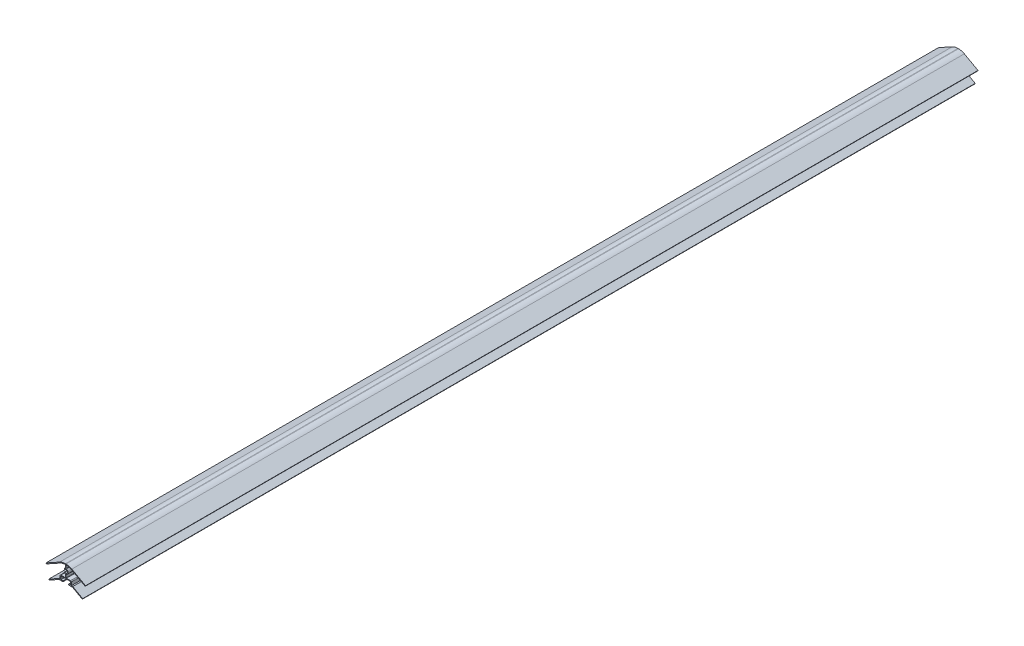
ISO-10303-21;
HEADER;
FILE_DESCRIPTION(('STEP AP214'),'2;1');
FILE_NAME('part.step','',(''),(''),'','','');
FILE_SCHEMA(('AUTOMOTIVE_DESIGN { 1 0 10303 214 1 1 1 1 }'));
ENDSEC;
DATA;
#1=APPLICATION_CONTEXT('core data for automotive mechanical design processes');
#2=APPLICATION_PROTOCOL_DEFINITION('international standard','automotive_design',2000,#1);
#3=PRODUCT_CONTEXT('',#1,'mechanical');
#4=PRODUCT('Part','Part','',(#3));
#5=PRODUCT_RELATED_PRODUCT_CATEGORY('part','',(#4));
#6=PRODUCT_DEFINITION_FORMATION('','',#4);
#7=PRODUCT_DEFINITION_CONTEXT('part definition',#1,'design');
#8=PRODUCT_DEFINITION('design','',#6,#7);
#9=PRODUCT_DEFINITION_SHAPE('','',#8);
#10=(LENGTH_UNIT() NAMED_UNIT(*) SI_UNIT(.MILLI.,.METRE.));
#11=(NAMED_UNIT(*) PLANE_ANGLE_UNIT() SI_UNIT($,.RADIAN.));
#12=(NAMED_UNIT(*) SI_UNIT($,.STERADIAN.) SOLID_ANGLE_UNIT());
#13=UNCERTAINTY_MEASURE_WITH_UNIT(LENGTH_MEASURE(1.E-05),#10,'distance_accuracy_value','');
#14=(GEOMETRIC_REPRESENTATION_CONTEXT(3) GLOBAL_UNCERTAINTY_ASSIGNED_CONTEXT((#13)) GLOBAL_UNIT_ASSIGNED_CONTEXT((#10,
#11,#12)) REPRESENTATION_CONTEXT('',''));
#15=CARTESIAN_POINT('',(0.,0.,0.));
#16=DIRECTION('',(0.,0.,1.));
#17=DIRECTION('',(1.,0.,0.));
#18=AXIS2_PLACEMENT_3D('',#15,#16,#17);
#19=CARTESIAN_POINT('',(-0.37073623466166,-6.88884441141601,-1118.));
#20=DIRECTION('',(0.,0.,1.));
#21=DIRECTION('',(1.,0.,0.));
#22=AXIS2_PLACEMENT_3D('',#19,#20,#21);
#23=CYLINDRICAL_SURFACE('',#22,15.);
#24=CARTESIAN_POINT('',(-0.37073623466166,-6.88884441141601,0.));
#25=DIRECTION('',(0.,0.,1.));
#26=DIRECTION('',(-1.,0.,0.));
#27=AXIS2_PLACEMENT_3D('',#24,#25,#26);
#28=CIRCLE('',#27,15.);
#29=CARTESIAN_POINT('',(-0.370736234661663,8.111155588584,0.));
#30=VERTEX_POINT('',#29);
#31=CARTESIAN_POINT('',(-7.64288053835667,6.23045119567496,0.));
#32=VERTEX_POINT('',#31);
#33=EDGE_CURVE('E417',#30,#32,#28,.T.);
#34=ORIENTED_EDGE('',*,*,#33,.F.);
#35=DIRECTION('',(0.,0.,1.));
#36=VECTOR('',#35,1.);
#37=CARTESIAN_POINT('',(-0.370736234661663,8.111155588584,-1118.));
#38=LINE('',#37,#36);
#39=CARTESIAN_POINT('',(-0.370736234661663,8.111155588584,-1118.));
#40=VERTEX_POINT('',#39);
#41=EDGE_CURVE('E11',#40,#30,#38,.T.);
#42=ORIENTED_EDGE('',*,*,#41,.F.);
#43=CARTESIAN_POINT('',(-0.37073623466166,-6.88884441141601,-1118.));
#44=DIRECTION('',(0.,0.,1.));
#45=DIRECTION('',(-1.,0.,0.));
#46=AXIS2_PLACEMENT_3D('',#43,#44,#45);
#47=CIRCLE('',#46,15.);
#48=CARTESIAN_POINT('',(-7.64288053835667,6.23045119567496,-1118.));
#49=VERTEX_POINT('',#48);
#50=EDGE_CURVE('E581',#40,#49,#47,.T.);
#51=ORIENTED_EDGE('',*,*,#50,.T.);
#52=DIRECTION('',(0.,0.,1.));
#53=VECTOR('',#52,1.);
#54=CARTESIAN_POINT('',(-7.64288053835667,6.23045119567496,-1118.));
#55=LINE('',#54,#53);
#56=EDGE_CURVE('E35',#49,#32,#55,.T.);
#57=ORIENTED_EDGE('',*,*,#56,.T.);
#58=EDGE_LOOP('',(#34,#42,#51,#57));
#59=FACE_BOUND('',#58,.T.);
#60=ADVANCED_FACE('F32',(#59),#23,.T.);
#61=CARTESIAN_POINT('',(0.370736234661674,8.111155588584,-1118.));
#62=DIRECTION('',(0.,1.,0.));
#63=DIRECTION('',(0.,0.,1.));
#64=AXIS2_PLACEMENT_3D('',#61,#62,#63);
#65=PLANE('',#64);
#66=DIRECTION('',(-1.,0.,0.));
#67=VECTOR('',#66,1.);
#68=CARTESIAN_POINT('',(0.370736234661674,8.111155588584,0.));
#69=LINE('',#68,#67);
#70=CARTESIAN_POINT('',(0.370736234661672,8.111155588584,0.));
#71=VERTEX_POINT('',#70);
#72=EDGE_CURVE('E579',#71,#30,#69,.T.);
#73=ORIENTED_EDGE('',*,*,#72,.F.);
#74=DIRECTION('',(0.,0.,1.));
#75=VECTOR('',#74,1.);
#76=CARTESIAN_POINT('',(0.370736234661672,8.111155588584,-1118.));
#77=LINE('',#76,#75);
#78=CARTESIAN_POINT('',(0.370736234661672,8.111155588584,-1118.));
#79=VERTEX_POINT('',#78);
#80=EDGE_CURVE('E41',#79,#71,#77,.T.);
#81=ORIENTED_EDGE('',*,*,#80,.F.);
#82=DIRECTION('',(-1.,0.,0.));
#83=VECTOR('',#82,1.);
#84=CARTESIAN_POINT('',(0.370736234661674,8.111155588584,-1118.));
#85=LINE('',#84,#83);
#86=EDGE_CURVE('E407',#79,#40,#85,.T.);
#87=ORIENTED_EDGE('',*,*,#86,.T.);
#88=ORIENTED_EDGE('',*,*,#41,.T.);
#89=EDGE_LOOP('',(#73,#81,#87,#88));
#90=FACE_BOUND('',#89,.T.);
#91=ADVANCED_FACE('F689',(#90),#65,.T.);
#92=CARTESIAN_POINT('',(0.370736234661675,-6.88884441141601,-1118.));
#93=DIRECTION('',(0.,0.,1.));
#94=DIRECTION('',(1.,0.,0.));
#95=AXIS2_PLACEMENT_3D('',#92,#93,#94);
#96=CYLINDRICAL_SURFACE('',#95,15.);
#97=CARTESIAN_POINT('',(0.370736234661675,-6.88884441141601,0.));
#98=DIRECTION('',(0.,0.,1.));
#99=DIRECTION('',(1.,0.,0.));
#100=AXIS2_PLACEMENT_3D('',#97,#98,#99);
#101=CIRCLE('',#100,15.);
#102=CARTESIAN_POINT('',(7.64288053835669,6.23045119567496,0.));
#103=VERTEX_POINT('',#102);
#104=EDGE_CURVE('E394',#103,#71,#101,.T.);
#105=ORIENTED_EDGE('',*,*,#104,.F.);
#106=DIRECTION('',(0.,0.,1.));
#107=VECTOR('',#106,1.);
#108=CARTESIAN_POINT('',(7.64288053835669,6.23045119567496,-1118.));
#109=LINE('',#108,#107);
#110=CARTESIAN_POINT('',(7.64288053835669,6.23045119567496,-1118.));
#111=VERTEX_POINT('',#110);
#112=EDGE_CURVE('E389',#111,#103,#109,.T.);
#113=ORIENTED_EDGE('',*,*,#112,.F.);
#114=CARTESIAN_POINT('',(0.370736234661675,-6.88884441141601,-1118.));
#115=DIRECTION('',(0.,0.,1.));
#116=DIRECTION('',(1.,0.,0.));
#117=AXIS2_PLACEMENT_3D('',#114,#115,#116);
#118=CIRCLE('',#117,15.);
#119=EDGE_CURVE('E392',#111,#79,#118,.T.);
#120=ORIENTED_EDGE('',*,*,#119,.T.);
#121=ORIENTED_EDGE('',*,*,#80,.T.);
#122=EDGE_LOOP('',(#105,#113,#120,#121));
#123=FACE_BOUND('',#122,.T.);
#124=ADVANCED_FACE('F391',(#123),#96,.T.);
#125=CARTESIAN_POINT('',(7.64288053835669,6.23045119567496,-1118.));
#126=DIRECTION('',(0.484809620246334,0.874619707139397,0.));
#127=DIRECTION('',(-0.874619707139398,0.484809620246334,0.));
#128=AXIS2_PLACEMENT_3D('',#125,#126,#127);
#129=PLANE('',#128);
#130=DIRECTION('',(-0.874619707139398,0.484809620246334,0.));
#131=VECTOR('',#130,1.);
#132=CARTESIAN_POINT('',(7.64288053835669,6.23045119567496,0.));
#133=LINE('',#132,#131);
#134=CARTESIAN_POINT('',(24.75,-3.25217996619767,0.));
#135=VERTEX_POINT('',#134);
#136=EDGE_CURVE('E576',#135,#103,#133,.T.);
#137=ORIENTED_EDGE('',*,*,#136,.F.);
#138=DIRECTION('',(0.,0.,1.));
#139=VECTOR('',#138,1.);
#140=CARTESIAN_POINT('',(24.75,-3.25217996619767,-1118.));
#141=LINE('',#140,#139);
#142=CARTESIAN_POINT('',(24.75,-3.25217996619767,-1118.));
#143=VERTEX_POINT('',#142);
#144=EDGE_CURVE('E399',#143,#135,#141,.T.);
#145=ORIENTED_EDGE('',*,*,#144,.F.);
#146=DIRECTION('',(-0.874619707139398,0.484809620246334,0.));
#147=VECTOR('',#146,1.);
#148=CARTESIAN_POINT('',(7.64288053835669,6.23045119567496,-1118.));
#149=LINE('',#148,#147);
#150=EDGE_CURVE('E405',#143,#111,#149,.T.);
#151=ORIENTED_EDGE('',*,*,#150,.T.);
#152=ORIENTED_EDGE('',*,*,#112,.T.);
#153=EDGE_LOOP('',(#137,#145,#151,#152));
#154=FACE_BOUND('',#153,.T.);
#155=ADVANCED_FACE('F409',(#154),#129,.T.);
#156=CARTESIAN_POINT('',(24.75,-3.25217996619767,-1118.));
#157=DIRECTION('',(0.874619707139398,-0.484809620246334,0.));
#158=DIRECTION('',(0.484809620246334,0.874619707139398,0.));
#159=AXIS2_PLACEMENT_3D('',#156,#157,#158);
#160=PLANE('',#159);
#161=DIRECTION('',(0.484809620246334,0.874619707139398,0.));
#162=VECTOR('',#161,1.);
#163=CARTESIAN_POINT('',(24.75,-3.25217996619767,0.));
#164=LINE('',#163,#162);
#165=CARTESIAN_POINT('',(24.2651903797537,-4.12679967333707,0.));
#166=VERTEX_POINT('',#165);
#167=EDGE_CURVE('E573',#166,#135,#164,.T.);
#168=ORIENTED_EDGE('',*,*,#167,.F.);
#169=DIRECTION('',(0.,0.,1.));
#170=VECTOR('',#169,1.);
#171=CARTESIAN_POINT('',(24.2651903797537,-4.12679967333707,-1118.));
#172=LINE('',#171,#170);
#173=CARTESIAN_POINT('',(24.2651903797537,-4.12679967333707,-1118.));
#174=VERTEX_POINT('',#173);
#175=EDGE_CURVE('E585',#174,#166,#172,.T.);
#176=ORIENTED_EDGE('',*,*,#175,.F.);
#177=DIRECTION('',(0.484809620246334,0.874619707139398,0.));
#178=VECTOR('',#177,1.);
#179=CARTESIAN_POINT('',(24.75,-3.25217996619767,-1118.));
#180=LINE('',#179,#178);
#181=EDGE_CURVE('E410',#174,#143,#180,.T.);
#182=ORIENTED_EDGE('',*,*,#181,.T.);
#183=ORIENTED_EDGE('',*,*,#144,.T.);
#184=EDGE_LOOP('',(#168,#176,#182,#183));
#185=FACE_BOUND('',#184,.T.);
#186=ADVANCED_FACE('F702',(#185),#160,.T.);
#187=CARTESIAN_POINT('',(7.15807091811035,5.35583148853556,-1118.));
#188=DIRECTION('',(-0.484809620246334,-0.874619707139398,0.));
#189=DIRECTION('',(0.874619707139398,-0.484809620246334,0.));
#190=AXIS2_PLACEMENT_3D('',#187,#188,#189);
#191=PLANE('',#190);
#192=DIRECTION('',(0.874619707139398,-0.484809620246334,0.));
#193=VECTOR('',#192,1.);
#194=CARTESIAN_POINT('',(7.15807091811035,5.35583148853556,0.));
#195=LINE('',#194,#193);
#196=CARTESIAN_POINT('',(7.15807091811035,5.35583148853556,0.));
#197=VERTEX_POINT('',#196);
#198=EDGE_CURVE('E570',#197,#166,#195,.T.);
#199=ORIENTED_EDGE('',*,*,#198,.F.);
#200=DIRECTION('',(0.,0.,1.));
#201=VECTOR('',#200,1.);
#202=CARTESIAN_POINT('',(7.15807091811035,5.35583148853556,-1118.));
#203=LINE('',#202,#201);
#204=CARTESIAN_POINT('',(7.15807091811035,5.35583148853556,-1118.));
#205=VERTEX_POINT('',#204);
#206=EDGE_CURVE('E587',#205,#197,#203,.T.);
#207=ORIENTED_EDGE('',*,*,#206,.F.);
#208=DIRECTION('',(0.874619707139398,-0.484809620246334,0.));
#209=VECTOR('',#208,1.);
#210=CARTESIAN_POINT('',(7.15807091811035,5.35583148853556,-1118.));
#211=LINE('',#210,#209);
#212=EDGE_CURVE('E412',#205,#174,#211,.T.);
#213=ORIENTED_EDGE('',*,*,#212,.T.);
#214=ORIENTED_EDGE('',*,*,#175,.T.);
#215=EDGE_LOOP('',(#199,#207,#213,#214));
#216=FACE_BOUND('',#215,.T.);
#217=ADVANCED_FACE('F705',(#216),#191,.T.);
#218=CARTESIAN_POINT('',(0.370736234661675,-6.88884441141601,-1118.));
#219=DIRECTION('',(0.,0.,1.));
#220=DIRECTION('',(1.,0.,0.));
#221=AXIS2_PLACEMENT_3D('',#218,#219,#220);
#222=CYLINDRICAL_SURFACE('',#221,14.);
#223=CARTESIAN_POINT('',(0.370736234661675,-6.88884441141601,0.));
#224=DIRECTION('',(0.,0.,-1.));
#225=DIRECTION('',(1.,0.,0.));
#226=AXIS2_PLACEMENT_3D('',#223,#224,#225);
#227=CIRCLE('',#226,14.);
#228=CARTESIAN_POINT('',(0.915566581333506,7.10055013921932,0.));
#229=VERTEX_POINT('',#228);
#230=EDGE_CURVE('E567',#229,#197,#227,.T.);
#231=ORIENTED_EDGE('',*,*,#230,.F.);
#232=DIRECTION('',(0.,0.,1.));
#233=VECTOR('',#232,1.);
#234=CARTESIAN_POINT('',(0.915566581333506,7.10055013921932,-1118.));
#235=LINE('',#234,#233);
#236=CARTESIAN_POINT('',(0.915566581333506,7.10055013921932,-1118.));
#237=VERTEX_POINT('',#236);
#238=EDGE_CURVE('E589',#237,#229,#235,.T.);
#239=ORIENTED_EDGE('',*,*,#238,.F.);
#240=CARTESIAN_POINT('',(0.370736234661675,-6.88884441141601,-1118.));
#241=DIRECTION('',(0.,0.,-1.));
#242=DIRECTION('',(1.,0.,0.));
#243=AXIS2_PLACEMENT_3D('',#240,#241,#242);
#244=CIRCLE('',#243,14.);
#245=EDGE_CURVE('E1436',#237,#205,#244,.T.);
#246=ORIENTED_EDGE('',*,*,#245,.T.);
#247=ORIENTED_EDGE('',*,*,#206,.T.);
#248=EDGE_LOOP('',(#231,#239,#246,#247));
#249=FACE_BOUND('',#248,.T.);
#250=ADVANCED_FACE('F709',(#249),#222,.F.);
#251=CARTESIAN_POINT('',(0.900000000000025,6.70085315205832,-1118.));
#252=DIRECTION('',(0.,0.,1.));
#253=DIRECTION('',(1.,0.,0.));
#254=AXIS2_PLACEMENT_3D('',#251,#252,#253);
#255=CYLINDRICAL_SURFACE('',#254,0.399999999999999);
#256=CARTESIAN_POINT('',(0.900000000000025,6.70085315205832,0.));
#257=DIRECTION('',(0.,0.,-1.));
#258=DIRECTION('',(-1.,0.,0.));
#259=AXIS2_PLACEMENT_3D('',#256,#257,#258);
#260=CIRCLE('',#259,0.399999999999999);
#261=CARTESIAN_POINT('',(0.500000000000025,6.70085315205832,0.));
#262=VERTEX_POINT('',#261);
#263=EDGE_CURVE('E564',#262,#229,#260,.T.);
#264=ORIENTED_EDGE('',*,*,#263,.F.);
#265=DIRECTION('',(0.,0.,1.));
#266=VECTOR('',#265,1.);
#267=CARTESIAN_POINT('',(0.500000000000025,6.70085315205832,-1118.));
#268=LINE('',#267,#266);
#269=CARTESIAN_POINT('',(0.500000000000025,6.70085315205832,-1118.));
#270=VERTEX_POINT('',#269);
#271=EDGE_CURVE('E591',#270,#262,#268,.T.);
#272=ORIENTED_EDGE('',*,*,#271,.F.);
#273=CARTESIAN_POINT('',(0.900000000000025,6.70085315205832,-1118.));
#274=DIRECTION('',(0.,0.,-1.));
#275=DIRECTION('',(-1.,0.,0.));
#276=AXIS2_PLACEMENT_3D('',#273,#274,#275);
#277=CIRCLE('',#276,0.399999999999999);
#278=EDGE_CURVE('E1429',#270,#237,#277,.T.);
#279=ORIENTED_EDGE('',*,*,#278,.T.);
#280=ORIENTED_EDGE('',*,*,#238,.T.);
#281=EDGE_LOOP('',(#264,#272,#279,#280));
#282=FACE_BOUND('',#281,.T.);
#283=ADVANCED_FACE('F713',(#282),#255,.F.);
#284=CARTESIAN_POINT('',(0.500000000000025,6.70085315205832,-1118.));
#285=DIRECTION('',(1.,0.,0.));
#286=DIRECTION('',(0.,1.,0.));
#287=AXIS2_PLACEMENT_3D('',#284,#285,#286);
#288=PLANE('',#287);
#289=DIRECTION('',(0.,1.,0.));
#290=VECTOR('',#289,1.);
#291=CARTESIAN_POINT('',(0.500000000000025,6.70085315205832,0.));
#292=LINE('',#291,#290);
#293=CARTESIAN_POINT('',(0.500000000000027,3.278719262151,0.));
#294=VERTEX_POINT('',#293);
#295=EDGE_CURVE('E561',#294,#262,#292,.T.);
#296=ORIENTED_EDGE('',*,*,#295,.F.);
#297=DIRECTION('',(0.,0.,1.));
#298=VECTOR('',#297,1.);
#299=CARTESIAN_POINT('',(0.500000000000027,3.278719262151,-1118.));
#300=LINE('',#299,#298);
#301=CARTESIAN_POINT('',(0.500000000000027,3.278719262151,-1118.));
#302=VERTEX_POINT('',#301);
#303=EDGE_CURVE('E593',#302,#294,#300,.T.);
#304=ORIENTED_EDGE('',*,*,#303,.F.);
#305=DIRECTION('',(0.,1.,0.));
#306=VECTOR('',#305,1.);
#307=CARTESIAN_POINT('',(0.500000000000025,6.70085315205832,-1118.));
#308=LINE('',#307,#306);
#309=EDGE_CURVE('E1425',#302,#270,#308,.T.);
#310=ORIENTED_EDGE('',*,*,#309,.T.);
#311=ORIENTED_EDGE('',*,*,#271,.T.);
#312=EDGE_LOOP('',(#296,#304,#310,#311));
#313=FACE_BOUND('',#312,.T.);
#314=ADVANCED_FACE('F717',(#313),#288,.T.);
#315=CARTESIAN_POINT('',(0.900000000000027,3.278719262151,-1118.));
#316=DIRECTION('',(0.,0.,1.));
#317=DIRECTION('',(1.,0.,0.));
#318=AXIS2_PLACEMENT_3D('',#315,#316,#317);
#319=CYLINDRICAL_SURFACE('',#318,0.400000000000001);
#320=CARTESIAN_POINT('',(0.900000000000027,3.278719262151,0.));
#321=DIRECTION('',(0.,0.,-1.));
#322=DIRECTION('',(-1.,0.,0.));
#323=AXIS2_PLACEMENT_3D('',#320,#321,#322);
#324=CIRCLE('',#323,0.400000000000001);
#325=CARTESIAN_POINT('',(0.794117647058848,2.89298758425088,0.));
#326=VERTEX_POINT('',#325);
#327=EDGE_CURVE('E558',#326,#294,#324,.T.);
#328=ORIENTED_EDGE('',*,*,#327,.F.);
#329=DIRECTION('',(0.,0.,1.));
#330=VECTOR('',#329,1.);
#331=CARTESIAN_POINT('',(0.794117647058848,2.89298758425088,-1118.));
#332=LINE('',#331,#330);
#333=CARTESIAN_POINT('',(0.794117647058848,2.89298758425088,-1118.));
#334=VERTEX_POINT('',#333);
#335=EDGE_CURVE('E595',#334,#326,#332,.T.);
#336=ORIENTED_EDGE('',*,*,#335,.F.);
#337=CARTESIAN_POINT('',(0.900000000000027,3.278719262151,-1118.));
#338=DIRECTION('',(0.,0.,-1.));
#339=DIRECTION('',(-1.,0.,0.));
#340=AXIS2_PLACEMENT_3D('',#337,#338,#339);
#341=CIRCLE('',#340,0.400000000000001);
#342=EDGE_CURVE('E1441',#334,#302,#341,.T.);
#343=ORIENTED_EDGE('',*,*,#342,.T.);
#344=ORIENTED_EDGE('',*,*,#303,.T.);
#345=EDGE_LOOP('',(#328,#336,#343,#344));
#346=FACE_BOUND('',#345,.T.);
#347=ADVANCED_FACE('F721',(#346),#319,.F.);
#348=CARTESIAN_POINT('',(0.,0.,-1118.));
#349=DIRECTION('',(0.,0.,1.));
#350=DIRECTION('',(1.,0.,0.));
#351=AXIS2_PLACEMENT_3D('',#348,#349,#350);
#352=CYLINDRICAL_SURFACE('',#351,3.);
#353=CARTESIAN_POINT('',(0.,0.,0.));
#354=DIRECTION('',(0.,0.,1.));
#355=DIRECTION('',(1.,0.,0.));
#356=AXIS2_PLACEMENT_3D('',#353,#354,#355);
#357=CIRCLE('',#356,3.);
#358=CARTESIAN_POINT('',(0.794117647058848,-2.89298758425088,0.));
#359=VERTEX_POINT('',#358);
#360=EDGE_CURVE('E555',#359,#326,#357,.T.);
#361=ORIENTED_EDGE('',*,*,#360,.F.);
#362=DIRECTION('',(0.,0.,1.));
#363=VECTOR('',#362,1.);
#364=CARTESIAN_POINT('',(0.794117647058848,-2.89298758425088,-1118.));
#365=LINE('',#364,#363);
#366=CARTESIAN_POINT('',(0.794117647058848,-2.89298758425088,-1118.));
#367=VERTEX_POINT('',#366);
#368=EDGE_CURVE('E597',#367,#359,#365,.T.);
#369=ORIENTED_EDGE('',*,*,#368,.F.);
#370=CARTESIAN_POINT('',(0.,0.,-1118.));
#371=DIRECTION('',(0.,0.,1.));
#372=DIRECTION('',(1.,0.,0.));
#373=AXIS2_PLACEMENT_3D('',#370,#371,#372);
#374=CIRCLE('',#373,3.);
#375=EDGE_CURVE('E1418',#367,#334,#374,.T.);
#376=ORIENTED_EDGE('',*,*,#375,.T.);
#377=ORIENTED_EDGE('',*,*,#335,.T.);
#378=EDGE_LOOP('',(#361,#369,#376,#377));
#379=FACE_BOUND('',#378,.T.);
#380=ADVANCED_FACE('F725',(#379),#352,.T.);
#381=CARTESIAN_POINT('',(0.900000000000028,-3.27871926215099,-1118.));
#382=DIRECTION('',(0.,0.,1.));
#383=DIRECTION('',(1.,0.,0.));
#384=AXIS2_PLACEMENT_3D('',#381,#382,#383);
#385=CYLINDRICAL_SURFACE('',#384,0.4);
#386=CARTESIAN_POINT('',(0.900000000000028,-3.27871926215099,0.));
#387=DIRECTION('',(0.,0.,-1.));
#388=DIRECTION('',(-1.,0.,0.));
#389=AXIS2_PLACEMENT_3D('',#386,#387,#388);
#390=CIRCLE('',#389,0.4);
#391=CARTESIAN_POINT('',(0.500000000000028,-3.278719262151,0.));
#392=VERTEX_POINT('',#391);
#393=EDGE_CURVE('E552',#392,#359,#390,.T.);
#394=ORIENTED_EDGE('',*,*,#393,.F.);
#395=DIRECTION('',(0.,0.,1.));
#396=VECTOR('',#395,1.);
#397=CARTESIAN_POINT('',(0.500000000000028,-3.278719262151,-1118.));
#398=LINE('',#397,#396);
#399=CARTESIAN_POINT('',(0.500000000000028,-3.278719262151,-1118.));
#400=VERTEX_POINT('',#399);
#401=EDGE_CURVE('E599',#400,#392,#398,.T.);
#402=ORIENTED_EDGE('',*,*,#401,.F.);
#403=CARTESIAN_POINT('',(0.900000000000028,-3.27871926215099,-1118.));
#404=DIRECTION('',(0.,0.,-1.));
#405=DIRECTION('',(-1.,0.,0.));
#406=AXIS2_PLACEMENT_3D('',#403,#404,#405);
#407=CIRCLE('',#406,0.4);
#408=EDGE_CURVE('E1414',#400,#367,#407,.T.);
#409=ORIENTED_EDGE('',*,*,#408,.T.);
#410=ORIENTED_EDGE('',*,*,#368,.T.);
#411=EDGE_LOOP('',(#394,#402,#409,#410));
#412=FACE_BOUND('',#411,.T.);
#413=ADVANCED_FACE('F729',(#412),#385,.F.);
#414=CARTESIAN_POINT('',(0.500000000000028,-3.278719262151,-1118.));
#415=DIRECTION('',(1.,0.,0.));
#416=DIRECTION('',(0.,1.,0.));
#417=AXIS2_PLACEMENT_3D('',#414,#415,#416);
#418=PLANE('',#417);
#419=DIRECTION('',(0.,1.,0.));
#420=VECTOR('',#419,1.);
#421=CARTESIAN_POINT('',(0.500000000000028,-3.278719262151,0.));
#422=LINE('',#421,#420);
#423=CARTESIAN_POINT('',(0.50000000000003,-6.70999999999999,0.));
#424=VERTEX_POINT('',#423);
#425=EDGE_CURVE('E549',#424,#392,#422,.T.);
#426=ORIENTED_EDGE('',*,*,#425,.F.);
#427=DIRECTION('',(0.,0.,1.));
#428=VECTOR('',#427,1.);
#429=CARTESIAN_POINT('',(0.50000000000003,-6.70999999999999,-1118.));
#430=LINE('',#429,#428);
#431=CARTESIAN_POINT('',(0.50000000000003,-6.70999999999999,-1118.));
#432=VERTEX_POINT('',#431);
#433=EDGE_CURVE('E601',#432,#424,#430,.T.);
#434=ORIENTED_EDGE('',*,*,#433,.F.);
#435=DIRECTION('',(0.,1.,0.));
#436=VECTOR('',#435,1.);
#437=CARTESIAN_POINT('',(0.500000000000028,-3.278719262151,-1118.));
#438=LINE('',#437,#436);
#439=EDGE_CURVE('E1445',#432,#400,#438,.T.);
#440=ORIENTED_EDGE('',*,*,#439,.T.);
#441=ORIENTED_EDGE('',*,*,#401,.T.);
#442=EDGE_LOOP('',(#426,#434,#440,#441));
#443=FACE_BOUND('',#442,.T.);
#444=ADVANCED_FACE('F733',(#443),#418,.T.);
#445=CARTESIAN_POINT('',(0.90000000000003,-6.71,-1118.));
#446=DIRECTION('',(0.,0.,1.));
#447=DIRECTION('',(1.,0.,0.));
#448=AXIS2_PLACEMENT_3D('',#445,#446,#447);
#449=CYLINDRICAL_SURFACE('',#448,0.4);
#450=CARTESIAN_POINT('',(0.90000000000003,-6.71,0.));
#451=DIRECTION('',(0.,0.,-1.));
#452=DIRECTION('',(1.,0.,0.));
#453=AXIS2_PLACEMENT_3D('',#450,#451,#452);
#454=CIRCLE('',#453,0.4);
#455=CARTESIAN_POINT('',(0.900000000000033,-7.11,0.));
#456=VERTEX_POINT('',#455);
#457=EDGE_CURVE('E546',#456,#424,#454,.T.);
#458=ORIENTED_EDGE('',*,*,#457,.F.);
#459=DIRECTION('',(0.,0.,1.));
#460=VECTOR('',#459,1.);
#461=CARTESIAN_POINT('',(0.900000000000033,-7.11,-1118.));
#462=LINE('',#461,#460);
#463=CARTESIAN_POINT('',(0.900000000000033,-7.11,-1118.));
#464=VERTEX_POINT('',#463);
#465=EDGE_CURVE('E603',#464,#456,#462,.T.);
#466=ORIENTED_EDGE('',*,*,#465,.F.);
#467=CARTESIAN_POINT('',(0.90000000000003,-6.71,-1118.));
#468=DIRECTION('',(0.,0.,-1.));
#469=DIRECTION('',(1.,0.,0.));
#470=AXIS2_PLACEMENT_3D('',#467,#468,#469);
#471=CIRCLE('',#470,0.4);
#472=EDGE_CURVE('E1407',#464,#432,#471,.T.);
#473=ORIENTED_EDGE('',*,*,#472,.T.);
#474=ORIENTED_EDGE('',*,*,#433,.T.);
#475=EDGE_LOOP('',(#458,#466,#473,#474));
#476=FACE_BOUND('',#475,.T.);
#477=ADVANCED_FACE('F737',(#476),#449,.F.);
#478=CARTESIAN_POINT('',(0.900000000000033,-7.11,-1118.));
#479=DIRECTION('',(0.,1.,0.));
#480=DIRECTION('',(-1.,0.,0.));
#481=AXIS2_PLACEMENT_3D('',#478,#479,#480);
#482=PLANE('',#481);
#483=DIRECTION('',(-1.,0.,0.));
#484=VECTOR('',#483,1.);
#485=CARTESIAN_POINT('',(0.900000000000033,-7.11,0.));
#486=LINE('',#485,#484);
#487=CARTESIAN_POINT('',(6.00000000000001,-7.11,0.));
#488=VERTEX_POINT('',#487);
#489=EDGE_CURVE('E543',#488,#456,#486,.T.);
#490=ORIENTED_EDGE('',*,*,#489,.F.);
#491=DIRECTION('',(0.,0.,1.));
#492=VECTOR('',#491,1.);
#493=CARTESIAN_POINT('',(6.00000000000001,-7.11,-1118.));
#494=LINE('',#493,#492);
#495=CARTESIAN_POINT('',(6.00000000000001,-7.11,-1118.));
#496=VERTEX_POINT('',#495);
#497=EDGE_CURVE('E605',#496,#488,#494,.T.);
#498=ORIENTED_EDGE('',*,*,#497,.F.);
#499=DIRECTION('',(-1.,0.,0.));
#500=VECTOR('',#499,1.);
#501=CARTESIAN_POINT('',(0.900000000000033,-7.11,-1118.));
#502=LINE('',#501,#500);
#503=EDGE_CURVE('E1403',#496,#464,#502,.T.);
#504=ORIENTED_EDGE('',*,*,#503,.T.);
#505=ORIENTED_EDGE('',*,*,#465,.T.);
#506=EDGE_LOOP('',(#490,#498,#504,#505));
#507=FACE_BOUND('',#506,.T.);
#508=ADVANCED_FACE('F741',(#507),#482,.T.);
#509=CARTESIAN_POINT('',(6.00000000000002,-8.11,-1118.));
#510=DIRECTION('',(0.,0.,1.));
#511=DIRECTION('',(1.,0.,0.));
#512=AXIS2_PLACEMENT_3D('',#509,#510,#511);
#513=CYLINDRICAL_SURFACE('',#512,1.);
#514=CARTESIAN_POINT('',(6.00000000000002,-8.11,0.));
#515=DIRECTION('',(0.,0.,1.));
#516=DIRECTION('',(1.,0.,0.));
#517=AXIS2_PLACEMENT_3D('',#514,#515,#516);
#518=CIRCLE('',#517,1.);
#519=CARTESIAN_POINT('',(7.00000000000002,-8.11000000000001,0.));
#520=VERTEX_POINT('',#519);
#521=EDGE_CURVE('E540',#520,#488,#518,.T.);
#522=ORIENTED_EDGE('',*,*,#521,.F.);
#523=DIRECTION('',(0.,0.,1.));
#524=VECTOR('',#523,1.);
#525=CARTESIAN_POINT('',(7.00000000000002,-8.11000000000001,-1118.));
#526=LINE('',#525,#524);
#527=CARTESIAN_POINT('',(7.00000000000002,-8.11000000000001,-1118.));
#528=VERTEX_POINT('',#527);
#529=EDGE_CURVE('E607',#528,#520,#526,.T.);
#530=ORIENTED_EDGE('',*,*,#529,.F.);
#531=CARTESIAN_POINT('',(6.00000000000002,-8.11,-1118.));
#532=DIRECTION('',(0.,0.,1.));
#533=DIRECTION('',(1.,0.,0.));
#534=AXIS2_PLACEMENT_3D('',#531,#532,#533);
#535=CIRCLE('',#534,1.);
#536=EDGE_CURVE('E1449',#528,#496,#535,.T.);
#537=ORIENTED_EDGE('',*,*,#536,.T.);
#538=ORIENTED_EDGE('',*,*,#497,.T.);
#539=EDGE_LOOP('',(#522,#530,#537,#538));
#540=FACE_BOUND('',#539,.T.);
#541=ADVANCED_FACE('F745',(#540),#513,.T.);
#542=CARTESIAN_POINT('',(7.00000000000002,-8.11000000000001,-1118.));
#543=DIRECTION('',(1.,0.,0.));
#544=DIRECTION('',(0.,1.,0.));
#545=AXIS2_PLACEMENT_3D('',#542,#543,#544);
#546=PLANE('',#545);
#547=DIRECTION('',(0.,1.,0.));
#548=VECTOR('',#547,1.);
#549=CARTESIAN_POINT('',(7.00000000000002,-8.11000000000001,0.));
#550=LINE('',#549,#548);
#551=CARTESIAN_POINT('',(7.00000000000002,-12.11,0.));
#552=VERTEX_POINT('',#551);
#553=EDGE_CURVE('E537',#552,#520,#550,.T.);
#554=ORIENTED_EDGE('',*,*,#553,.F.);
#555=DIRECTION('',(0.,0.,1.));
#556=VECTOR('',#555,1.);
#557=CARTESIAN_POINT('',(7.00000000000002,-12.11,-1118.));
#558=LINE('',#557,#556);
#559=CARTESIAN_POINT('',(7.00000000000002,-12.11,-1118.));
#560=VERTEX_POINT('',#559);
#561=EDGE_CURVE('E609',#560,#552,#558,.T.);
#562=ORIENTED_EDGE('',*,*,#561,.F.);
#563=DIRECTION('',(0.,1.,0.));
#564=VECTOR('',#563,1.);
#565=CARTESIAN_POINT('',(7.00000000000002,-8.11000000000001,-1118.));
#566=LINE('',#565,#564);
#567=EDGE_CURVE('E1396',#560,#528,#566,.T.);
#568=ORIENTED_EDGE('',*,*,#567,.T.);
#569=ORIENTED_EDGE('',*,*,#529,.T.);
#570=EDGE_LOOP('',(#554,#562,#568,#569));
#571=FACE_BOUND('',#570,.T.);
#572=ADVANCED_FACE('F749',(#571),#546,.T.);
#573=CARTESIAN_POINT('',(7.00000000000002,-12.11,-1118.));
#574=DIRECTION('',(0.,1.,0.));
#575=DIRECTION('',(0.,0.,1.));
#576=AXIS2_PLACEMENT_3D('',#573,#574,#575);
#577=PLANE('',#576);
#578=DIRECTION('',(-1.,0.,0.));
#579=VECTOR('',#578,1.);
#580=CARTESIAN_POINT('',(7.00000000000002,-12.11,0.));
#581=LINE('',#580,#579);
#582=CARTESIAN_POINT('',(8.75861758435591,-12.11,0.));
#583=VERTEX_POINT('',#582);
#584=EDGE_CURVE('E534',#583,#552,#581,.T.);
#585=ORIENTED_EDGE('',*,*,#584,.F.);
#586=DIRECTION('',(0.,0.,1.));
#587=VECTOR('',#586,1.);
#588=CARTESIAN_POINT('',(8.75861758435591,-12.11,-1118.));
#589=LINE('',#588,#587);
#590=CARTESIAN_POINT('',(8.75861758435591,-12.11,-1118.));
#591=VERTEX_POINT('',#590);
#592=EDGE_CURVE('E611',#591,#583,#589,.T.);
#593=ORIENTED_EDGE('',*,*,#592,.F.);
#594=DIRECTION('',(-1.,0.,0.));
#595=VECTOR('',#594,1.);
#596=CARTESIAN_POINT('',(7.00000000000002,-12.11,-1118.));
#597=LINE('',#596,#595);
#598=EDGE_CURVE('E1392',#591,#560,#597,.T.);
#599=ORIENTED_EDGE('',*,*,#598,.T.);
#600=ORIENTED_EDGE('',*,*,#561,.T.);
#601=EDGE_LOOP('',(#585,#593,#599,#600));
#602=FACE_BOUND('',#601,.T.);
#603=ADVANCED_FACE('F753',(#602),#577,.T.);
#604=CARTESIAN_POINT('',(8.75861758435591,-12.11,-1118.));
#605=DIRECTION('',(0.484809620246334,0.874619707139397,0.));
#606=DIRECTION('',(-0.874619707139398,0.484809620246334,0.));
#607=AXIS2_PLACEMENT_3D('',#604,#605,#606);
#608=PLANE('',#607);
#609=DIRECTION('',(-0.874619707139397,0.484809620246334,0.));
#610=VECTOR('',#609,1.);
#611=CARTESIAN_POINT('',(8.75861758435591,-12.11,0.));
#612=LINE('',#611,#610);
#613=CARTESIAN_POINT('',(21.2294855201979,-19.0227149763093,0.));
#614=VERTEX_POINT('',#613);
#615=EDGE_CURVE('E531',#614,#583,#612,.T.);
#616=ORIENTED_EDGE('',*,*,#615,.F.);
#617=DIRECTION('',(0.,0.,1.));
#618=VECTOR('',#617,1.);
#619=CARTESIAN_POINT('',(21.2294855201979,-19.0227149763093,-1118.));
#620=LINE('',#619,#618);
#621=CARTESIAN_POINT('',(21.2294855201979,-19.0227149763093,-1118.));
#622=VERTEX_POINT('',#621);
#623=EDGE_CURVE('E613',#622,#614,#620,.T.);
#624=ORIENTED_EDGE('',*,*,#623,.F.);
#625=DIRECTION('',(-0.874619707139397,0.484809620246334,0.));
#626=VECTOR('',#625,1.);
#627=CARTESIAN_POINT('',(8.75861758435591,-12.11,-1118.));
#628=LINE('',#627,#626);
#629=EDGE_CURVE('E1453',#622,#591,#628,.T.);
#630=ORIENTED_EDGE('',*,*,#629,.T.);
#631=ORIENTED_EDGE('',*,*,#592,.T.);
#632=EDGE_LOOP('',(#616,#624,#630,#631));
#633=FACE_BOUND('',#632,.T.);
#634=ADVANCED_FACE('F757',(#633),#608,.T.);
#635=CARTESIAN_POINT('',(21.2294855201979,-19.0227149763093,-1118.));
#636=DIRECTION('',(0.874619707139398,-0.484809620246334,0.));
#637=DIRECTION('',(0.484809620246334,0.874619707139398,0.));
#638=AXIS2_PLACEMENT_3D('',#635,#636,#637);
#639=PLANE('',#638);
#640=DIRECTION('',(0.484809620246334,0.874619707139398,0.));
#641=VECTOR('',#640,1.);
#642=CARTESIAN_POINT('',(21.2294855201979,-19.0227149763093,0.));
#643=LINE('',#642,#641);
#644=CARTESIAN_POINT('',(20.7446758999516,-19.8973346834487,0.));
#645=VERTEX_POINT('',#644);
#646=EDGE_CURVE('E528',#645,#614,#643,.T.);
#647=ORIENTED_EDGE('',*,*,#646,.F.);
#648=DIRECTION('',(0.,0.,1.));
#649=VECTOR('',#648,1.);
#650=CARTESIAN_POINT('',(20.7446758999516,-19.8973346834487,-1118.));
#651=LINE('',#650,#649);
#652=CARTESIAN_POINT('',(20.7446758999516,-19.8973346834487,-1118.));
#653=VERTEX_POINT('',#652);
#654=EDGE_CURVE('E615',#653,#645,#651,.T.);
#655=ORIENTED_EDGE('',*,*,#654,.F.);
#656=DIRECTION('',(0.484809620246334,0.874619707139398,0.));
#657=VECTOR('',#656,1.);
#658=CARTESIAN_POINT('',(21.2294855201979,-19.0227149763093,-1118.));
#659=LINE('',#658,#657);
#660=EDGE_CURVE('E1385',#653,#622,#659,.T.);
#661=ORIENTED_EDGE('',*,*,#660,.T.);
#662=ORIENTED_EDGE('',*,*,#623,.T.);
#663=EDGE_LOOP('',(#647,#655,#661,#662));
#664=FACE_BOUND('',#663,.T.);
#665=ADVANCED_FACE('F761',(#664),#639,.T.);
#666=CARTESIAN_POINT('',(8.50000000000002,-13.11,-1118.));
#667=DIRECTION('',(-0.484809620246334,-0.874619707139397,0.));
#668=DIRECTION('',(0.874619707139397,-0.484809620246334,0.));
#669=AXIS2_PLACEMENT_3D('',#666,#667,#668);
#670=PLANE('',#669);
#671=DIRECTION('',(0.874619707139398,-0.484809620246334,0.));
#672=VECTOR('',#671,1.);
#673=CARTESIAN_POINT('',(8.50000000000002,-13.11,0.));
#674=LINE('',#673,#672);
#675=CARTESIAN_POINT('',(8.50000000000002,-13.11,0.));
#676=VERTEX_POINT('',#675);
#677=EDGE_CURVE('E525',#676,#645,#674,.T.);
#678=ORIENTED_EDGE('',*,*,#677,.F.);
#679=DIRECTION('',(0.,0.,1.));
#680=VECTOR('',#679,1.);
#681=CARTESIAN_POINT('',(8.50000000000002,-13.11,-1118.));
#682=LINE('',#681,#680);
#683=CARTESIAN_POINT('',(8.50000000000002,-13.11,-1118.));
#684=VERTEX_POINT('',#683);
#685=EDGE_CURVE('E617',#684,#676,#682,.T.);
#686=ORIENTED_EDGE('',*,*,#685,.F.);
#687=DIRECTION('',(0.874619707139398,-0.484809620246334,0.));
#688=VECTOR('',#687,1.);
#689=CARTESIAN_POINT('',(8.50000000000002,-13.11,-1118.));
#690=LINE('',#689,#688);
#691=EDGE_CURVE('E1381',#684,#653,#690,.T.);
#692=ORIENTED_EDGE('',*,*,#691,.T.);
#693=ORIENTED_EDGE('',*,*,#654,.T.);
#694=EDGE_LOOP('',(#678,#686,#692,#693));
#695=FACE_BOUND('',#694,.T.);
#696=ADVANCED_FACE('F765',(#695),#670,.T.);
#697=CARTESIAN_POINT('',(3.50000000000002,-13.11,-1118.));
#698=DIRECTION('',(0.,-1.,0.));
#699=DIRECTION('',(1.,0.,0.));
#700=AXIS2_PLACEMENT_3D('',#697,#698,#699);
#701=PLANE('',#700);
#702=DIRECTION('',(1.,0.,0.));
#703=VECTOR('',#702,1.);
#704=CARTESIAN_POINT('',(3.50000000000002,-13.11,0.));
#705=LINE('',#704,#703);
#706=CARTESIAN_POINT('',(3.50000000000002,-13.11,0.));
#707=VERTEX_POINT('',#706);
#708=EDGE_CURVE('E522',#707,#676,#705,.T.);
#709=ORIENTED_EDGE('',*,*,#708,.F.);
#710=DIRECTION('',(0.,0.,1.));
#711=VECTOR('',#710,1.);
#712=CARTESIAN_POINT('',(3.50000000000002,-13.11,-1118.));
#713=LINE('',#712,#711);
#714=CARTESIAN_POINT('',(3.50000000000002,-13.11,-1118.));
#715=VERTEX_POINT('',#714);
#716=EDGE_CURVE('E619',#715,#707,#713,.T.);
#717=ORIENTED_EDGE('',*,*,#716,.F.);
#718=DIRECTION('',(1.,0.,0.));
#719=VECTOR('',#718,1.);
#720=CARTESIAN_POINT('',(3.50000000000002,-13.11,-1118.));
#721=LINE('',#720,#719);
#722=EDGE_CURVE('E1457',#715,#684,#721,.T.);
#723=ORIENTED_EDGE('',*,*,#722,.T.);
#724=ORIENTED_EDGE('',*,*,#685,.T.);
#725=EDGE_LOOP('',(#709,#717,#723,#724));
#726=FACE_BOUND('',#725,.T.);
#727=ADVANCED_FACE('F769',(#726),#701,.T.);
#728=CARTESIAN_POINT('',(3.50000000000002,-13.11,-1118.));
#729=DIRECTION('',(-1.,0.,0.));
#730=DIRECTION('',(0.,-1.,0.));
#731=AXIS2_PLACEMENT_3D('',#728,#729,#730);
#732=PLANE('',#731);
#733=DIRECTION('',(0.,-1.,0.));
#734=VECTOR('',#733,1.);
#735=CARTESIAN_POINT('',(3.50000000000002,-13.11,0.));
#736=LINE('',#735,#734);
#737=CARTESIAN_POINT('',(3.50000000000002,-12.11,0.));
#738=VERTEX_POINT('',#737);
#739=EDGE_CURVE('E519',#738,#707,#736,.T.);
#740=ORIENTED_EDGE('',*,*,#739,.F.);
#741=DIRECTION('',(0.,0.,1.));
#742=VECTOR('',#741,1.);
#743=CARTESIAN_POINT('',(3.50000000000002,-12.11,-1118.));
#744=LINE('',#743,#742);
#745=CARTESIAN_POINT('',(3.50000000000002,-12.11,-1118.));
#746=VERTEX_POINT('',#745);
#747=EDGE_CURVE('E621',#746,#738,#744,.T.);
#748=ORIENTED_EDGE('',*,*,#747,.F.);
#749=DIRECTION('',(0.,-1.,0.));
#750=VECTOR('',#749,1.);
#751=CARTESIAN_POINT('',(3.50000000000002,-13.11,-1118.));
#752=LINE('',#751,#750);
#753=EDGE_CURVE('E1374',#746,#715,#752,.T.);
#754=ORIENTED_EDGE('',*,*,#753,.T.);
#755=ORIENTED_EDGE('',*,*,#716,.T.);
#756=EDGE_LOOP('',(#740,#748,#754,#755));
#757=FACE_BOUND('',#756,.T.);
#758=ADVANCED_FACE('F773',(#757),#732,.T.);
#759=CARTESIAN_POINT('',(3.50000000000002,-12.11,-1118.));
#760=DIRECTION('',(0.,1.,0.));
#761=DIRECTION('',(0.,0.,1.));
#762=AXIS2_PLACEMENT_3D('',#759,#760,#761);
#763=PLANE('',#762);
#764=DIRECTION('',(-1.,0.,0.));
#765=VECTOR('',#764,1.);
#766=CARTESIAN_POINT('',(3.50000000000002,-12.11,0.));
#767=LINE('',#766,#765);
#768=CARTESIAN_POINT('',(6.00000000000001,-12.11,0.));
#769=VERTEX_POINT('',#768);
#770=EDGE_CURVE('E516',#769,#738,#767,.T.);
#771=ORIENTED_EDGE('',*,*,#770,.F.);
#772=DIRECTION('',(0.,0.,1.));
#773=VECTOR('',#772,1.);
#774=CARTESIAN_POINT('',(6.00000000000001,-12.11,-1118.));
#775=LINE('',#774,#773);
#776=CARTESIAN_POINT('',(6.00000000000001,-12.11,-1118.));
#777=VERTEX_POINT('',#776);
#778=EDGE_CURVE('E623',#777,#769,#775,.T.);
#779=ORIENTED_EDGE('',*,*,#778,.F.);
#780=DIRECTION('',(-1.,0.,0.));
#781=VECTOR('',#780,1.);
#782=CARTESIAN_POINT('',(3.50000000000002,-12.11,-1118.));
#783=LINE('',#782,#781);
#784=EDGE_CURVE('E1370',#777,#746,#783,.T.);
#785=ORIENTED_EDGE('',*,*,#784,.T.);
#786=ORIENTED_EDGE('',*,*,#747,.T.);
#787=EDGE_LOOP('',(#771,#779,#785,#786));
#788=FACE_BOUND('',#787,.T.);
#789=ADVANCED_FACE('F777',(#788),#763,.T.);
#790=CARTESIAN_POINT('',(6.00000000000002,-8.11,-1118.));
#791=DIRECTION('',(-1.,0.,0.));
#792=DIRECTION('',(0.,-1.,0.));
#793=AXIS2_PLACEMENT_3D('',#790,#791,#792);
#794=PLANE('',#793);
#795=DIRECTION('',(0.,-1.,0.));
#796=VECTOR('',#795,1.);
#797=CARTESIAN_POINT('',(6.00000000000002,-8.11,0.));
#798=LINE('',#797,#796);
#799=CARTESIAN_POINT('',(6.00000000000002,-8.11,0.));
#800=VERTEX_POINT('',#799);
#801=EDGE_CURVE('E513',#800,#769,#798,.T.);
#802=ORIENTED_EDGE('',*,*,#801,.F.);
#803=DIRECTION('',(0.,0.,1.));
#804=VECTOR('',#803,1.);
#805=CARTESIAN_POINT('',(6.00000000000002,-8.11,-1118.));
#806=LINE('',#805,#804);
#807=CARTESIAN_POINT('',(6.00000000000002,-8.11,-1118.));
#808=VERTEX_POINT('',#807);
#809=EDGE_CURVE('E625',#808,#800,#806,.T.);
#810=ORIENTED_EDGE('',*,*,#809,.F.);
#811=DIRECTION('',(0.,-1.,0.));
#812=VECTOR('',#811,1.);
#813=CARTESIAN_POINT('',(6.00000000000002,-8.11,-1118.));
#814=LINE('',#813,#812);
#815=EDGE_CURVE('E1461',#808,#777,#814,.T.);
#816=ORIENTED_EDGE('',*,*,#815,.T.);
#817=ORIENTED_EDGE('',*,*,#778,.T.);
#818=EDGE_LOOP('',(#802,#810,#816,#817));
#819=FACE_BOUND('',#818,.T.);
#820=ADVANCED_FACE('F781',(#819),#794,.T.);
#821=CARTESIAN_POINT('',(6.00000000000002,-8.11,-1118.));
#822=DIRECTION('',(0.,-1.,0.));
#823=DIRECTION('',(1.,0.,0.));
#824=AXIS2_PLACEMENT_3D('',#821,#822,#823);
#825=PLANE('',#824);
#826=DIRECTION('',(1.,0.,0.));
#827=VECTOR('',#826,1.);
#828=CARTESIAN_POINT('',(6.00000000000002,-8.11,0.));
#829=LINE('',#828,#827);
#830=CARTESIAN_POINT('',(-6.,-8.11,0.));
#831=VERTEX_POINT('',#830);
#832=EDGE_CURVE('E510',#831,#800,#829,.T.);
#833=ORIENTED_EDGE('',*,*,#832,.F.);
#834=DIRECTION('',(0.,0.,1.));
#835=VECTOR('',#834,1.);
#836=CARTESIAN_POINT('',(-6.,-8.11,-1118.));
#837=LINE('',#836,#835);
#838=CARTESIAN_POINT('',(-6.,-8.11,-1118.));
#839=VERTEX_POINT('',#838);
#840=EDGE_CURVE('E627',#839,#831,#837,.T.);
#841=ORIENTED_EDGE('',*,*,#840,.F.);
#842=DIRECTION('',(1.,0.,0.));
#843=VECTOR('',#842,1.);
#844=CARTESIAN_POINT('',(6.00000000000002,-8.11,-1118.));
#845=LINE('',#844,#843);
#846=EDGE_CURVE('E1363',#839,#808,#845,.T.);
#847=ORIENTED_EDGE('',*,*,#846,.T.);
#848=ORIENTED_EDGE('',*,*,#809,.T.);
#849=EDGE_LOOP('',(#833,#841,#847,#848));
#850=FACE_BOUND('',#849,.T.);
#851=ADVANCED_FACE('F785',(#850),#825,.T.);
#852=CARTESIAN_POINT('',(-6.,-8.11,-1118.));
#853=DIRECTION('',(1.,0.,0.));
#854=DIRECTION('',(0.,1.,0.));
#855=AXIS2_PLACEMENT_3D('',#852,#853,#854);
#856=PLANE('',#855);
#857=DIRECTION('',(0.,1.,0.));
#858=VECTOR('',#857,1.);
#859=CARTESIAN_POINT('',(-6.,-8.11,0.));
#860=LINE('',#859,#858);
#861=CARTESIAN_POINT('',(-6.,-12.11,0.));
#862=VERTEX_POINT('',#861);
#863=EDGE_CURVE('E507',#862,#831,#860,.T.);
#864=ORIENTED_EDGE('',*,*,#863,.F.);
#865=DIRECTION('',(0.,0.,1.));
#866=VECTOR('',#865,1.);
#867=CARTESIAN_POINT('',(-6.,-12.11,-1118.));
#868=LINE('',#867,#866);
#869=CARTESIAN_POINT('',(-6.,-12.11,-1118.));
#870=VERTEX_POINT('',#869);
#871=EDGE_CURVE('E629',#870,#862,#868,.T.);
#872=ORIENTED_EDGE('',*,*,#871,.F.);
#873=DIRECTION('',(0.,1.,0.));
#874=VECTOR('',#873,1.);
#875=CARTESIAN_POINT('',(-6.,-8.11,-1118.));
#876=LINE('',#875,#874);
#877=EDGE_CURVE('E1359',#870,#839,#876,.T.);
#878=ORIENTED_EDGE('',*,*,#877,.T.);
#879=ORIENTED_EDGE('',*,*,#840,.T.);
#880=EDGE_LOOP('',(#864,#872,#878,#879));
#881=FACE_BOUND('',#880,.T.);
#882=ADVANCED_FACE('F789',(#881),#856,.T.);
#883=CARTESIAN_POINT('',(-3.50000000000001,-12.11,-1118.));
#884=DIRECTION('',(0.,1.,0.));
#885=DIRECTION('',(-1.,0.,0.));
#886=AXIS2_PLACEMENT_3D('',#883,#884,#885);
#887=PLANE('',#886);
#888=DIRECTION('',(-1.,0.,0.));
#889=VECTOR('',#888,1.);
#890=CARTESIAN_POINT('',(-3.50000000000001,-12.11,0.));
#891=LINE('',#890,#889);
#892=CARTESIAN_POINT('',(-3.50000000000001,-12.11,0.));
#893=VERTEX_POINT('',#892);
#894=EDGE_CURVE('E504',#893,#862,#891,.T.);
#895=ORIENTED_EDGE('',*,*,#894,.F.);
#896=DIRECTION('',(0.,0.,1.));
#897=VECTOR('',#896,1.);
#898=CARTESIAN_POINT('',(-3.50000000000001,-12.11,-1118.));
#899=LINE('',#898,#897);
#900=CARTESIAN_POINT('',(-3.50000000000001,-12.11,-1118.));
#901=VERTEX_POINT('',#900);
#902=EDGE_CURVE('E631',#901,#893,#899,.T.);
#903=ORIENTED_EDGE('',*,*,#902,.F.);
#904=DIRECTION('',(-1.,0.,0.));
#905=VECTOR('',#904,1.);
#906=CARTESIAN_POINT('',(-3.50000000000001,-12.11,-1118.));
#907=LINE('',#906,#905);
#908=EDGE_CURVE('E1465',#901,#870,#907,.T.);
#909=ORIENTED_EDGE('',*,*,#908,.T.);
#910=ORIENTED_EDGE('',*,*,#871,.T.);
#911=EDGE_LOOP('',(#895,#903,#909,#910));
#912=FACE_BOUND('',#911,.T.);
#913=ADVANCED_FACE('F793',(#912),#887,.T.);
#914=CARTESIAN_POINT('',(-3.50000000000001,-13.11,-1118.));
#915=DIRECTION('',(1.,0.,0.));
#916=DIRECTION('',(0.,0.,-1.));
#917=AXIS2_PLACEMENT_3D('',#914,#915,#916);
#918=PLANE('',#917);
#919=DIRECTION('',(0.,1.,0.));
#920=VECTOR('',#919,1.);
#921=CARTESIAN_POINT('',(-3.50000000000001,-13.11,0.));
#922=LINE('',#921,#920);
#923=CARTESIAN_POINT('',(-3.50000000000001,-13.11,0.));
#924=VERTEX_POINT('',#923);
#925=EDGE_CURVE('E501',#924,#893,#922,.T.);
#926=ORIENTED_EDGE('',*,*,#925,.F.);
#927=DIRECTION('',(0.,0.,1.));
#928=VECTOR('',#927,1.);
#929=CARTESIAN_POINT('',(-3.50000000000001,-13.11,-1118.));
#930=LINE('',#929,#928);
#931=CARTESIAN_POINT('',(-3.50000000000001,-13.11,-1118.));
#932=VERTEX_POINT('',#931);
#933=EDGE_CURVE('E633',#932,#924,#930,.T.);
#934=ORIENTED_EDGE('',*,*,#933,.F.);
#935=DIRECTION('',(0.,1.,0.));
#936=VECTOR('',#935,1.);
#937=CARTESIAN_POINT('',(-3.50000000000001,-13.11,-1118.));
#938=LINE('',#937,#936);
#939=EDGE_CURVE('E1352',#932,#901,#938,.T.);
#940=ORIENTED_EDGE('',*,*,#939,.T.);
#941=ORIENTED_EDGE('',*,*,#902,.T.);
#942=EDGE_LOOP('',(#926,#934,#940,#941));
#943=FACE_BOUND('',#942,.T.);
#944=ADVANCED_FACE('F797',(#943),#918,.T.);
#945=CARTESIAN_POINT('',(-3.50000000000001,-13.11,-1118.));
#946=DIRECTION('',(0.,-1.,0.));
#947=DIRECTION('',(0.,0.,-1.));
#948=AXIS2_PLACEMENT_3D('',#945,#946,#947);
#949=PLANE('',#948);
#950=DIRECTION('',(1.,0.,0.));
#951=VECTOR('',#950,1.);
#952=CARTESIAN_POINT('',(-3.50000000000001,-13.11,0.));
#953=LINE('',#952,#951);
#954=CARTESIAN_POINT('',(-8.50000000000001,-13.11,0.));
#955=VERTEX_POINT('',#954);
#956=EDGE_CURVE('E498',#955,#924,#953,.T.);
#957=ORIENTED_EDGE('',*,*,#956,.F.);
#958=DIRECTION('',(0.,0.,1.));
#959=VECTOR('',#958,1.);
#960=CARTESIAN_POINT('',(-8.50000000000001,-13.11,-1118.));
#961=LINE('',#960,#959);
#962=CARTESIAN_POINT('',(-8.50000000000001,-13.11,-1118.));
#963=VERTEX_POINT('',#962);
#964=EDGE_CURVE('E635',#963,#955,#961,.T.);
#965=ORIENTED_EDGE('',*,*,#964,.F.);
#966=DIRECTION('',(1.,0.,0.));
#967=VECTOR('',#966,1.);
#968=CARTESIAN_POINT('',(-3.50000000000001,-13.11,-1118.));
#969=LINE('',#968,#967);
#970=EDGE_CURVE('E1348',#963,#932,#969,.T.);
#971=ORIENTED_EDGE('',*,*,#970,.T.);
#972=ORIENTED_EDGE('',*,*,#933,.T.);
#973=EDGE_LOOP('',(#957,#965,#971,#972));
#974=FACE_BOUND('',#973,.T.);
#975=ADVANCED_FACE('F801',(#974),#949,.T.);
#976=CARTESIAN_POINT('',(-8.50000000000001,-13.11,-1118.));
#977=DIRECTION('',(0.484809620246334,-0.874619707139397,0.));
#978=DIRECTION('',(0.874619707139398,0.484809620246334,0.));
#979=AXIS2_PLACEMENT_3D('',#976,#977,#978);
#980=PLANE('',#979);
#981=DIRECTION('',(0.874619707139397,0.484809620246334,0.));
#982=VECTOR('',#981,1.);
#983=CARTESIAN_POINT('',(-8.50000000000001,-13.11,0.));
#984=LINE('',#983,#982);
#985=CARTESIAN_POINT('',(-20.7446758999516,-19.8973346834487,0.));
#986=VERTEX_POINT('',#985);
#987=EDGE_CURVE('E495',#986,#955,#984,.T.);
#988=ORIENTED_EDGE('',*,*,#987,.F.);
#989=DIRECTION('',(0.,0.,1.));
#990=VECTOR('',#989,1.);
#991=CARTESIAN_POINT('',(-20.7446758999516,-19.8973346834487,-1118.));
#992=LINE('',#991,#990);
#993=CARTESIAN_POINT('',(-20.7446758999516,-19.8973346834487,-1118.));
#994=VERTEX_POINT('',#993);
#995=EDGE_CURVE('E637',#994,#986,#992,.T.);
#996=ORIENTED_EDGE('',*,*,#995,.F.);
#997=DIRECTION('',(0.874619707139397,0.484809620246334,0.));
#998=VECTOR('',#997,1.);
#999=CARTESIAN_POINT('',(-8.50000000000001,-13.11,-1118.));
#1000=LINE('',#999,#998);
#1001=EDGE_CURVE('E1469',#994,#963,#1000,.T.);
#1002=ORIENTED_EDGE('',*,*,#1001,.T.);
#1003=ORIENTED_EDGE('',*,*,#964,.T.);
#1004=EDGE_LOOP('',(#988,#996,#1002,#1003));
#1005=FACE_BOUND('',#1004,.T.);
#1006=ADVANCED_FACE('F805',(#1005),#980,.T.);
#1007=CARTESIAN_POINT('',(-21.2294855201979,-19.0227149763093,-1118.));
#1008=DIRECTION('',(-0.874619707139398,-0.484809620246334,0.));
#1009=DIRECTION('',(0.484809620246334,-0.874619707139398,0.));
#1010=AXIS2_PLACEMENT_3D('',#1007,#1008,#1009);
#1011=PLANE('',#1010);
#1012=DIRECTION('',(0.484809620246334,-0.874619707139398,0.));
#1013=VECTOR('',#1012,1.);
#1014=CARTESIAN_POINT('',(-21.2294855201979,-19.0227149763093,0.));
#1015=LINE('',#1014,#1013);
#1016=CARTESIAN_POINT('',(-21.2294855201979,-19.0227149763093,0.));
#1017=VERTEX_POINT('',#1016);
#1018=EDGE_CURVE('E492',#1017,#986,#1015,.T.);
#1019=ORIENTED_EDGE('',*,*,#1018,.F.);
#1020=DIRECTION('',(0.,0.,1.));
#1021=VECTOR('',#1020,1.);
#1022=CARTESIAN_POINT('',(-21.2294855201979,-19.0227149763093,-1118.));
#1023=LINE('',#1022,#1021);
#1024=CARTESIAN_POINT('',(-21.2294855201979,-19.0227149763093,-1118.));
#1025=VERTEX_POINT('',#1024);
#1026=EDGE_CURVE('E639',#1025,#1017,#1023,.T.);
#1027=ORIENTED_EDGE('',*,*,#1026,.F.);
#1028=DIRECTION('',(0.484809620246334,-0.874619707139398,0.));
#1029=VECTOR('',#1028,1.);
#1030=CARTESIAN_POINT('',(-21.2294855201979,-19.0227149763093,-1118.));
#1031=LINE('',#1030,#1029);
#1032=EDGE_CURVE('E1341',#1025,#994,#1031,.T.);
#1033=ORIENTED_EDGE('',*,*,#1032,.T.);
#1034=ORIENTED_EDGE('',*,*,#995,.T.);
#1035=EDGE_LOOP('',(#1019,#1027,#1033,#1034));
#1036=FACE_BOUND('',#1035,.T.);
#1037=ADVANCED_FACE('F809',(#1036),#1011,.T.);
#1038=CARTESIAN_POINT('',(-8.75861758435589,-12.11,-1118.));
#1039=DIRECTION('',(-0.484809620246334,0.874619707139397,0.));
#1040=DIRECTION('',(-0.874619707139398,-0.484809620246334,0.));
#1041=AXIS2_PLACEMENT_3D('',#1038,#1039,#1040);
#1042=PLANE('',#1041);
#1043=DIRECTION('',(-0.874619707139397,-0.484809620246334,0.));
#1044=VECTOR('',#1043,1.);
#1045=CARTESIAN_POINT('',(-8.75861758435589,-12.11,0.));
#1046=LINE('',#1045,#1044);
#1047=CARTESIAN_POINT('',(-8.75861758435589,-12.11,0.));
#1048=VERTEX_POINT('',#1047);
#1049=EDGE_CURVE('E489',#1048,#1017,#1046,.T.);
#1050=ORIENTED_EDGE('',*,*,#1049,.F.);
#1051=DIRECTION('',(0.,0.,1.));
#1052=VECTOR('',#1051,1.);
#1053=CARTESIAN_POINT('',(-8.75861758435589,-12.11,-1118.));
#1054=LINE('',#1053,#1052);
#1055=CARTESIAN_POINT('',(-8.75861758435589,-12.11,-1118.));
#1056=VERTEX_POINT('',#1055);
#1057=EDGE_CURVE('E641',#1056,#1048,#1054,.T.);
#1058=ORIENTED_EDGE('',*,*,#1057,.F.);
#1059=DIRECTION('',(-0.874619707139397,-0.484809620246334,0.));
#1060=VECTOR('',#1059,1.);
#1061=CARTESIAN_POINT('',(-8.75861758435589,-12.11,-1118.));
#1062=LINE('',#1061,#1060);
#1063=EDGE_CURVE('E1337',#1056,#1025,#1062,.T.);
#1064=ORIENTED_EDGE('',*,*,#1063,.T.);
#1065=ORIENTED_EDGE('',*,*,#1026,.T.);
#1066=EDGE_LOOP('',(#1050,#1058,#1064,#1065));
#1067=FACE_BOUND('',#1066,.T.);
#1068=ADVANCED_FACE('F813',(#1067),#1042,.T.);
#1069=CARTESIAN_POINT('',(-7.,-12.11,-1118.));
#1070=DIRECTION('',(0.,1.,0.));
#1071=DIRECTION('',(0.,0.,1.));
#1072=AXIS2_PLACEMENT_3D('',#1069,#1070,#1071);
#1073=PLANE('',#1072);
#1074=DIRECTION('',(-1.,0.,0.));
#1075=VECTOR('',#1074,1.);
#1076=CARTESIAN_POINT('',(-7.,-12.11,0.));
#1077=LINE('',#1076,#1075);
#1078=CARTESIAN_POINT('',(-7.,-12.11,0.));
#1079=VERTEX_POINT('',#1078);
#1080=EDGE_CURVE('E486',#1079,#1048,#1077,.T.);
#1081=ORIENTED_EDGE('',*,*,#1080,.F.);
#1082=DIRECTION('',(0.,0.,1.));
#1083=VECTOR('',#1082,1.);
#1084=CARTESIAN_POINT('',(-7.,-12.11,-1118.));
#1085=LINE('',#1084,#1083);
#1086=CARTESIAN_POINT('',(-7.,-12.11,-1118.));
#1087=VERTEX_POINT('',#1086);
#1088=EDGE_CURVE('E643',#1087,#1079,#1085,.T.);
#1089=ORIENTED_EDGE('',*,*,#1088,.F.);
#1090=DIRECTION('',(-1.,0.,0.));
#1091=VECTOR('',#1090,1.);
#1092=CARTESIAN_POINT('',(-7.,-12.11,-1118.));
#1093=LINE('',#1092,#1091);
#1094=EDGE_CURVE('E1473',#1087,#1056,#1093,.T.);
#1095=ORIENTED_EDGE('',*,*,#1094,.T.);
#1096=ORIENTED_EDGE('',*,*,#1057,.T.);
#1097=EDGE_LOOP('',(#1081,#1089,#1095,#1096));
#1098=FACE_BOUND('',#1097,.T.);
#1099=ADVANCED_FACE('F817',(#1098),#1073,.T.);
#1100=CARTESIAN_POINT('',(-7.,-8.11000000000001,-1118.));
#1101=DIRECTION('',(-1.,0.,0.));
#1102=DIRECTION('',(0.,-1.,0.));
#1103=AXIS2_PLACEMENT_3D('',#1100,#1101,#1102);
#1104=PLANE('',#1103);
#1105=DIRECTION('',(0.,-1.,0.));
#1106=VECTOR('',#1105,1.);
#1107=CARTESIAN_POINT('',(-7.,-8.11000000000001,0.));
#1108=LINE('',#1107,#1106);
#1109=CARTESIAN_POINT('',(-7.,-8.11000000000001,0.));
#1110=VERTEX_POINT('',#1109);
#1111=EDGE_CURVE('E483',#1110,#1079,#1108,.T.);
#1112=ORIENTED_EDGE('',*,*,#1111,.F.);
#1113=DIRECTION('',(0.,0.,1.));
#1114=VECTOR('',#1113,1.);
#1115=CARTESIAN_POINT('',(-7.,-8.11000000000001,-1118.));
#1116=LINE('',#1115,#1114);
#1117=CARTESIAN_POINT('',(-7.,-8.11000000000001,-1118.));
#1118=VERTEX_POINT('',#1117);
#1119=EDGE_CURVE('E645',#1118,#1110,#1116,.T.);
#1120=ORIENTED_EDGE('',*,*,#1119,.F.);
#1121=DIRECTION('',(0.,-1.,0.));
#1122=VECTOR('',#1121,1.);
#1123=CARTESIAN_POINT('',(-7.,-8.11000000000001,-1118.));
#1124=LINE('',#1123,#1122);
#1125=EDGE_CURVE('E1330',#1118,#1087,#1124,.T.);
#1126=ORIENTED_EDGE('',*,*,#1125,.T.);
#1127=ORIENTED_EDGE('',*,*,#1088,.T.);
#1128=EDGE_LOOP('',(#1112,#1120,#1126,#1127));
#1129=FACE_BOUND('',#1128,.T.);
#1130=ADVANCED_FACE('F821',(#1129),#1104,.T.);
#1131=CARTESIAN_POINT('',(-6.,-8.11,-1118.));
#1132=DIRECTION('',(0.,0.,1.));
#1133=DIRECTION('',(1.,0.,0.));
#1134=AXIS2_PLACEMENT_3D('',#1131,#1132,#1133);
#1135=CYLINDRICAL_SURFACE('',#1134,1.);
#1136=CARTESIAN_POINT('',(-6.,-8.11,0.));
#1137=DIRECTION('',(0.,0.,1.));
#1138=DIRECTION('',(-1.,0.,0.));
#1139=AXIS2_PLACEMENT_3D('',#1136,#1137,#1138);
#1140=CIRCLE('',#1139,1.);
#1141=CARTESIAN_POINT('',(-5.99999999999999,-7.11,0.));
#1142=VERTEX_POINT('',#1141);
#1143=EDGE_CURVE('E480',#1142,#1110,#1140,.T.);
#1144=ORIENTED_EDGE('',*,*,#1143,.F.);
#1145=DIRECTION('',(0.,0.,1.));
#1146=VECTOR('',#1145,1.);
#1147=CARTESIAN_POINT('',(-5.99999999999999,-7.11,-1118.));
#1148=LINE('',#1147,#1146);
#1149=CARTESIAN_POINT('',(-5.99999999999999,-7.11,-1118.));
#1150=VERTEX_POINT('',#1149);
#1151=EDGE_CURVE('E647',#1150,#1142,#1148,.T.);
#1152=ORIENTED_EDGE('',*,*,#1151,.F.);
#1153=CARTESIAN_POINT('',(-6.,-8.11,-1118.));
#1154=DIRECTION('',(0.,0.,1.));
#1155=DIRECTION('',(-1.,0.,0.));
#1156=AXIS2_PLACEMENT_3D('',#1153,#1154,#1155);
#1157=CIRCLE('',#1156,1.);
#1158=EDGE_CURVE('E1326',#1150,#1118,#1157,.T.);
#1159=ORIENTED_EDGE('',*,*,#1158,.T.);
#1160=ORIENTED_EDGE('',*,*,#1119,.T.);
#1161=EDGE_LOOP('',(#1144,#1152,#1159,#1160));
#1162=FACE_BOUND('',#1161,.T.);
#1163=ADVANCED_FACE('F825',(#1162),#1135,.T.);
#1164=CARTESIAN_POINT('',(-0.900000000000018,-7.11,-1118.));
#1165=DIRECTION('',(0.,1.,0.));
#1166=DIRECTION('',(-1.,0.,0.));
#1167=AXIS2_PLACEMENT_3D('',#1164,#1165,#1166);
#1168=PLANE('',#1167);
#1169=DIRECTION('',(-1.,0.,0.));
#1170=VECTOR('',#1169,1.);
#1171=CARTESIAN_POINT('',(-0.900000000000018,-7.11,0.));
#1172=LINE('',#1171,#1170);
#1173=CARTESIAN_POINT('',(-0.900000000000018,-7.11,0.));
#1174=VERTEX_POINT('',#1173);
#1175=EDGE_CURVE('E477',#1174,#1142,#1172,.T.);
#1176=ORIENTED_EDGE('',*,*,#1175,.F.);
#1177=DIRECTION('',(0.,0.,1.));
#1178=VECTOR('',#1177,1.);
#1179=CARTESIAN_POINT('',(-0.900000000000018,-7.11,-1118.));
#1180=LINE('',#1179,#1178);
#1181=CARTESIAN_POINT('',(-0.900000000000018,-7.11,-1118.));
#1182=VERTEX_POINT('',#1181);
#1183=EDGE_CURVE('E649',#1182,#1174,#1180,.T.);
#1184=ORIENTED_EDGE('',*,*,#1183,.F.);
#1185=DIRECTION('',(-1.,0.,0.));
#1186=VECTOR('',#1185,1.);
#1187=CARTESIAN_POINT('',(-0.900000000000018,-7.11,-1118.));
#1188=LINE('',#1187,#1186);
#1189=EDGE_CURVE('E1477',#1182,#1150,#1188,.T.);
#1190=ORIENTED_EDGE('',*,*,#1189,.T.);
#1191=ORIENTED_EDGE('',*,*,#1151,.T.);
#1192=EDGE_LOOP('',(#1176,#1184,#1190,#1191));
#1193=FACE_BOUND('',#1192,.T.);
#1194=ADVANCED_FACE('F829',(#1193),#1168,.T.);
#1195=CARTESIAN_POINT('',(-0.900000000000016,-6.71,-1118.));
#1196=DIRECTION('',(0.,0.,1.));
#1197=DIRECTION('',(1.,0.,0.));
#1198=AXIS2_PLACEMENT_3D('',#1195,#1196,#1197);
#1199=CYLINDRICAL_SURFACE('',#1198,0.4);
#1200=CARTESIAN_POINT('',(-0.900000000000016,-6.71,0.));
#1201=DIRECTION('',(0.,0.,-1.));
#1202=DIRECTION('',(-1.,0.,0.));
#1203=AXIS2_PLACEMENT_3D('',#1200,#1201,#1202);
#1204=CIRCLE('',#1203,0.4);
#1205=CARTESIAN_POINT('',(-0.500000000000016,-6.70999999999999,0.));
#1206=VERTEX_POINT('',#1205);
#1207=EDGE_CURVE('E474',#1206,#1174,#1204,.T.);
#1208=ORIENTED_EDGE('',*,*,#1207,.F.);
#1209=DIRECTION('',(0.,0.,1.));
#1210=VECTOR('',#1209,1.);
#1211=CARTESIAN_POINT('',(-0.500000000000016,-6.70999999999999,-1118.));
#1212=LINE('',#1211,#1210);
#1213=CARTESIAN_POINT('',(-0.500000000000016,-6.70999999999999,-1118.));
#1214=VERTEX_POINT('',#1213);
#1215=EDGE_CURVE('E651',#1214,#1206,#1212,.T.);
#1216=ORIENTED_EDGE('',*,*,#1215,.F.);
#1217=CARTESIAN_POINT('',(-0.900000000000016,-6.71,-1118.));
#1218=DIRECTION('',(0.,0.,-1.));
#1219=DIRECTION('',(-1.,0.,0.));
#1220=AXIS2_PLACEMENT_3D('',#1217,#1218,#1219);
#1221=CIRCLE('',#1220,0.4);
#1222=EDGE_CURVE('E1319',#1214,#1182,#1221,.T.);
#1223=ORIENTED_EDGE('',*,*,#1222,.T.);
#1224=ORIENTED_EDGE('',*,*,#1183,.T.);
#1225=EDGE_LOOP('',(#1208,#1216,#1223,#1224));
#1226=FACE_BOUND('',#1225,.T.);
#1227=ADVANCED_FACE('F833',(#1226),#1199,.F.);
#1228=CARTESIAN_POINT('',(-0.500000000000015,-3.278719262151,-1118.));
#1229=DIRECTION('',(-1.,0.,0.));
#1230=DIRECTION('',(0.,-1.,0.));
#1231=AXIS2_PLACEMENT_3D('',#1228,#1229,#1230);
#1232=PLANE('',#1231);
#1233=DIRECTION('',(0.,-1.,0.));
#1234=VECTOR('',#1233,1.);
#1235=CARTESIAN_POINT('',(-0.500000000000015,-3.278719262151,0.));
#1236=LINE('',#1235,#1234);
#1237=CARTESIAN_POINT('',(-0.500000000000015,-3.278719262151,0.));
#1238=VERTEX_POINT('',#1237);
#1239=EDGE_CURVE('E471',#1238,#1206,#1236,.T.);
#1240=ORIENTED_EDGE('',*,*,#1239,.F.);
#1241=DIRECTION('',(0.,0.,1.));
#1242=VECTOR('',#1241,1.);
#1243=CARTESIAN_POINT('',(-0.500000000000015,-3.278719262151,-1118.));
#1244=LINE('',#1243,#1242);
#1245=CARTESIAN_POINT('',(-0.500000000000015,-3.278719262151,-1118.));
#1246=VERTEX_POINT('',#1245);
#1247=EDGE_CURVE('E653',#1246,#1238,#1244,.T.);
#1248=ORIENTED_EDGE('',*,*,#1247,.F.);
#1249=DIRECTION('',(0.,-1.,0.));
#1250=VECTOR('',#1249,1.);
#1251=CARTESIAN_POINT('',(-0.500000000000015,-3.278719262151,-1118.));
#1252=LINE('',#1251,#1250);
#1253=EDGE_CURVE('E1315',#1246,#1214,#1252,.T.);
#1254=ORIENTED_EDGE('',*,*,#1253,.T.);
#1255=ORIENTED_EDGE('',*,*,#1215,.T.);
#1256=EDGE_LOOP('',(#1240,#1248,#1254,#1255));
#1257=FACE_BOUND('',#1256,.T.);
#1258=ADVANCED_FACE('F837',(#1257),#1232,.T.);
#1259=CARTESIAN_POINT('',(-0.900000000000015,-3.278719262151,-1118.));
#1260=DIRECTION('',(0.,0.,1.));
#1261=DIRECTION('',(1.,0.,0.));
#1262=AXIS2_PLACEMENT_3D('',#1259,#1260,#1261);
#1263=CYLINDRICAL_SURFACE('',#1262,0.4);
#1264=CARTESIAN_POINT('',(-0.900000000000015,-3.278719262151,0.));
#1265=DIRECTION('',(0.,0.,-1.));
#1266=DIRECTION('',(1.,0.,0.));
#1267=AXIS2_PLACEMENT_3D('',#1264,#1265,#1266);
#1268=CIRCLE('',#1267,0.4);
#1269=CARTESIAN_POINT('',(-0.794117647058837,-2.89298758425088,0.));
#1270=VERTEX_POINT('',#1269);
#1271=EDGE_CURVE('E468',#1270,#1238,#1268,.T.);
#1272=ORIENTED_EDGE('',*,*,#1271,.F.);
#1273=DIRECTION('',(0.,0.,1.));
#1274=VECTOR('',#1273,1.);
#1275=CARTESIAN_POINT('',(-0.794117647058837,-2.89298758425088,-1118.));
#1276=LINE('',#1275,#1274);
#1277=CARTESIAN_POINT('',(-0.794117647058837,-2.89298758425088,-1118.));
#1278=VERTEX_POINT('',#1277);
#1279=EDGE_CURVE('E655',#1278,#1270,#1276,.T.);
#1280=ORIENTED_EDGE('',*,*,#1279,.F.);
#1281=CARTESIAN_POINT('',(-0.900000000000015,-3.278719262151,-1118.));
#1282=DIRECTION('',(0.,0.,-1.));
#1283=DIRECTION('',(1.,0.,0.));
#1284=AXIS2_PLACEMENT_3D('',#1281,#1282,#1283);
#1285=CIRCLE('',#1284,0.4);
#1286=EDGE_CURVE('E1481',#1278,#1246,#1285,.T.);
#1287=ORIENTED_EDGE('',*,*,#1286,.T.);
#1288=ORIENTED_EDGE('',*,*,#1247,.T.);
#1289=EDGE_LOOP('',(#1272,#1280,#1287,#1288));
#1290=FACE_BOUND('',#1289,.T.);
#1291=ADVANCED_FACE('F841',(#1290),#1263,.F.);
#1292=CARTESIAN_POINT('',(0.,0.,-1118.));
#1293=DIRECTION('',(0.,0.,1.));
#1294=DIRECTION('',(1.,0.,0.));
#1295=AXIS2_PLACEMENT_3D('',#1292,#1293,#1294);
#1296=CYLINDRICAL_SURFACE('',#1295,3.);
#1297=CARTESIAN_POINT('',(0.,0.,0.));
#1298=DIRECTION('',(0.,0.,1.));
#1299=DIRECTION('',(1.,0.,0.));
#1300=AXIS2_PLACEMENT_3D('',#1297,#1298,#1299);
#1301=CIRCLE('',#1300,3.);
#1302=CARTESIAN_POINT('',(-1.76970865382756,-2.42242260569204,0.));
#1303=VERTEX_POINT('',#1302);
#1304=EDGE_CURVE('E465',#1303,#1270,#1301,.T.);
#1305=ORIENTED_EDGE('',*,*,#1304,.F.);
#1306=DIRECTION('',(0.,0.,1.));
#1307=VECTOR('',#1306,1.);
#1308=CARTESIAN_POINT('',(-1.76970865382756,-2.42242260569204,-1118.));
#1309=LINE('',#1308,#1307);
#1310=CARTESIAN_POINT('',(-1.76970865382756,-2.42242260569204,-1118.));
#1311=VERTEX_POINT('',#1310);
#1312=EDGE_CURVE('E657',#1311,#1303,#1309,.T.);
#1313=ORIENTED_EDGE('',*,*,#1312,.F.);
#1314=CARTESIAN_POINT('',(0.,0.,-1118.));
#1315=DIRECTION('',(0.,0.,1.));
#1316=DIRECTION('',(1.,0.,0.));
#1317=AXIS2_PLACEMENT_3D('',#1314,#1315,#1316);
#1318=CIRCLE('',#1317,3.);
#1319=EDGE_CURVE('E1308',#1311,#1278,#1318,.T.);
#1320=ORIENTED_EDGE('',*,*,#1319,.T.);
#1321=ORIENTED_EDGE('',*,*,#1279,.T.);
#1322=EDGE_LOOP('',(#1305,#1313,#1320,#1321));
#1323=FACE_BOUND('',#1322,.T.);
#1324=ADVANCED_FACE('F845',(#1323),#1296,.T.);
#1325=CARTESIAN_POINT('',(-1.53374749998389,-2.09943292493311,-1118.));
#1326=DIRECTION('',(0.,0.,1.));
#1327=DIRECTION('',(1.,0.,0.));
#1328=AXIS2_PLACEMENT_3D('',#1325,#1326,#1327);
#1329=CYLINDRICAL_SURFACE('',#1328,0.4);
#1330=CARTESIAN_POINT('',(-1.53374749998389,-2.09943292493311,0.));
#1331=DIRECTION('',(0.,0.,1.));
#1332=DIRECTION('',(-1.,0.,0.));
#1333=AXIS2_PLACEMENT_3D('',#1330,#1331,#1332);
#1334=CIRCLE('',#1333,0.4);
#1335=CARTESIAN_POINT('',(-1.81659021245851,-1.81659021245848,0.));
#1336=VERTEX_POINT('',#1335);
#1337=EDGE_CURVE('E462',#1336,#1303,#1334,.T.);
#1338=ORIENTED_EDGE('',*,*,#1337,.F.);
#1339=DIRECTION('',(0.,0.,1.));
#1340=VECTOR('',#1339,1.);
#1341=CARTESIAN_POINT('',(-1.81659021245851,-1.81659021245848,-1118.));
#1342=LINE('',#1341,#1340);
#1343=CARTESIAN_POINT('',(-1.81659021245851,-1.81659021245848,-1118.));
#1344=VERTEX_POINT('',#1343);
#1345=EDGE_CURVE('E659',#1344,#1336,#1342,.T.);
#1346=ORIENTED_EDGE('',*,*,#1345,.F.);
#1347=CARTESIAN_POINT('',(-1.53374749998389,-2.09943292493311,-1118.));
#1348=DIRECTION('',(0.,0.,1.));
#1349=DIRECTION('',(-1.,0.,0.));
#1350=AXIS2_PLACEMENT_3D('',#1347,#1348,#1349);
#1351=CIRCLE('',#1350,0.4);
#1352=EDGE_CURVE('E1304',#1344,#1311,#1351,.T.);
#1353=ORIENTED_EDGE('',*,*,#1352,.T.);
#1354=ORIENTED_EDGE('',*,*,#1312,.T.);
#1355=EDGE_LOOP('',(#1338,#1346,#1353,#1354));
#1356=FACE_BOUND('',#1355,.T.);
#1357=ADVANCED_FACE('F849',(#1356),#1329,.T.);
#1358=CARTESIAN_POINT('',(-1.67332005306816,-1.67332005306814,-1118.));
#1359=DIRECTION('',(-0.707106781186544,0.707106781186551,0.));
#1360=DIRECTION('',(-0.707106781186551,-0.707106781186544,0.));
#1361=AXIS2_PLACEMENT_3D('',#1358,#1359,#1360);
#1362=PLANE('',#1361);
#1363=DIRECTION('',(-0.707106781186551,-0.707106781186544,0.));
#1364=VECTOR('',#1363,1.);
#1365=CARTESIAN_POINT('',(-1.67332005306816,-1.67332005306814,0.));
#1366=LINE('',#1365,#1364);
#1367=CARTESIAN_POINT('',(-1.67332005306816,-1.67332005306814,0.));
#1368=VERTEX_POINT('',#1367);
#1369=EDGE_CURVE('E459',#1368,#1336,#1366,.T.);
#1370=ORIENTED_EDGE('',*,*,#1369,.F.);
#1371=DIRECTION('',(0.,0.,1.));
#1372=VECTOR('',#1371,1.);
#1373=CARTESIAN_POINT('',(-1.67332005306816,-1.67332005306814,-1118.));
#1374=LINE('',#1373,#1372);
#1375=CARTESIAN_POINT('',(-1.67332005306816,-1.67332005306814,-1118.));
#1376=VERTEX_POINT('',#1375);
#1377=EDGE_CURVE('E661',#1376,#1368,#1374,.T.);
#1378=ORIENTED_EDGE('',*,*,#1377,.F.);
#1379=DIRECTION('',(-0.707106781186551,-0.707106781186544,0.));
#1380=VECTOR('',#1379,1.);
#1381=CARTESIAN_POINT('',(-1.67332005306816,-1.67332005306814,-1118.));
#1382=LINE('',#1381,#1380);
#1383=EDGE_CURVE('E1485',#1376,#1344,#1382,.T.);
#1384=ORIENTED_EDGE('',*,*,#1383,.T.);
#1385=ORIENTED_EDGE('',*,*,#1345,.T.);
#1386=EDGE_LOOP('',(#1370,#1378,#1384,#1385));
#1387=FACE_BOUND('',#1386,.T.);
#1388=ADVANCED_FACE('F853',(#1387),#1362,.T.);
#1389=CARTESIAN_POINT('',(-1.39047734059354,-1.95616276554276,-1118.));
#1390=DIRECTION('',(0.,0.,1.));
#1391=DIRECTION('',(1.,0.,0.));
#1392=AXIS2_PLACEMENT_3D('',#1389,#1390,#1391);
#1393=CYLINDRICAL_SURFACE('',#1392,0.4);
#1394=CARTESIAN_POINT('',(-1.39047734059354,-1.95616276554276,0.));
#1395=DIRECTION('',(0.,0.,1.));
#1396=DIRECTION('',(-1.,0.,0.));
#1397=AXIS2_PLACEMENT_3D('',#1394,#1395,#1396);
#1398=CIRCLE('',#1397,0.4);
#1399=CARTESIAN_POINT('',(-1.15873111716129,-1.6301356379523,0.));
#1400=VERTEX_POINT('',#1399);
#1401=EDGE_CURVE('E456',#1400,#1368,#1398,.T.);
#1402=ORIENTED_EDGE('',*,*,#1401,.F.);
#1403=DIRECTION('',(0.,0.,1.));
#1404=VECTOR('',#1403,1.);
#1405=CARTESIAN_POINT('',(-1.15873111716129,-1.6301356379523,-1118.));
#1406=LINE('',#1405,#1404);
#1407=CARTESIAN_POINT('',(-1.15873111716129,-1.6301356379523,-1118.));
#1408=VERTEX_POINT('',#1407);
#1409=EDGE_CURVE('E663',#1408,#1400,#1406,.T.);
#1410=ORIENTED_EDGE('',*,*,#1409,.F.);
#1411=CARTESIAN_POINT('',(-1.39047734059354,-1.95616276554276,-1118.));
#1412=DIRECTION('',(0.,0.,1.));
#1413=DIRECTION('',(-1.,0.,0.));
#1414=AXIS2_PLACEMENT_3D('',#1411,#1412,#1413);
#1415=CIRCLE('',#1414,0.4);
#1416=EDGE_CURVE('E1297',#1408,#1376,#1415,.T.);
#1417=ORIENTED_EDGE('',*,*,#1416,.T.);
#1418=ORIENTED_EDGE('',*,*,#1377,.T.);
#1419=EDGE_LOOP('',(#1402,#1410,#1417,#1418));
#1420=FACE_BOUND('',#1419,.T.);
#1421=ADVANCED_FACE('F857',(#1420),#1393,.T.);
#1422=CARTESIAN_POINT('',(0.,0.,-1118.));
#1423=DIRECTION('',(0.,0.,1.));
#1424=DIRECTION('',(1.,0.,0.));
#1425=AXIS2_PLACEMENT_3D('',#1422,#1423,#1424);
#1426=CYLINDRICAL_SURFACE('',#1425,2.);
#1427=CARTESIAN_POINT('',(0.,0.,0.));
#1428=DIRECTION('',(0.,0.,-1.));
#1429=DIRECTION('',(1.,0.,0.));
#1430=AXIS2_PLACEMENT_3D('',#1427,#1428,#1429);
#1431=CIRCLE('',#1430,2.);
#1432=CARTESIAN_POINT('',(-1.15873111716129,1.6301356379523,0.));
#1433=VERTEX_POINT('',#1432);
#1434=EDGE_CURVE('E453',#1433,#1400,#1431,.T.);
#1435=ORIENTED_EDGE('',*,*,#1434,.F.);
#1436=DIRECTION('',(0.,0.,1.));
#1437=VECTOR('',#1436,1.);
#1438=CARTESIAN_POINT('',(-1.15873111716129,1.6301356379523,-1118.));
#1439=LINE('',#1438,#1437);
#1440=CARTESIAN_POINT('',(-1.15873111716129,1.6301356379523,-1118.));
#1441=VERTEX_POINT('',#1440);
#1442=EDGE_CURVE('E665',#1441,#1433,#1439,.T.);
#1443=ORIENTED_EDGE('',*,*,#1442,.F.);
#1444=CARTESIAN_POINT('',(0.,0.,-1118.));
#1445=DIRECTION('',(0.,0.,-1.));
#1446=DIRECTION('',(1.,0.,0.));
#1447=AXIS2_PLACEMENT_3D('',#1444,#1445,#1446);
#1448=CIRCLE('',#1447,2.);
#1449=EDGE_CURVE('E1293',#1441,#1408,#1448,.T.);
#1450=ORIENTED_EDGE('',*,*,#1449,.T.);
#1451=ORIENTED_EDGE('',*,*,#1409,.T.);
#1452=EDGE_LOOP('',(#1435,#1443,#1450,#1451));
#1453=FACE_BOUND('',#1452,.T.);
#1454=ADVANCED_FACE('F861',(#1453),#1426,.F.);
#1455=CARTESIAN_POINT('',(-1.39047734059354,1.95616276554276,-1118.));
#1456=DIRECTION('',(0.,0.,1.));
#1457=DIRECTION('',(1.,0.,0.));
#1458=AXIS2_PLACEMENT_3D('',#1455,#1456,#1457);
#1459=CYLINDRICAL_SURFACE('',#1458,0.4);
#1460=CARTESIAN_POINT('',(-1.39047734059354,1.95616276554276,0.));
#1461=DIRECTION('',(0.,0.,1.));
#1462=DIRECTION('',(1.,0.,0.));
#1463=AXIS2_PLACEMENT_3D('',#1460,#1461,#1462);
#1464=CIRCLE('',#1463,0.4);
#1465=CARTESIAN_POINT('',(-1.67332005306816,1.67332005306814,0.));
#1466=VERTEX_POINT('',#1465);
#1467=EDGE_CURVE('E450',#1466,#1433,#1464,.T.);
#1468=ORIENTED_EDGE('',*,*,#1467,.F.);
#1469=DIRECTION('',(0.,0.,1.));
#1470=VECTOR('',#1469,1.);
#1471=CARTESIAN_POINT('',(-1.67332005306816,1.67332005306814,-1118.));
#1472=LINE('',#1471,#1470);
#1473=CARTESIAN_POINT('',(-1.67332005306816,1.67332005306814,-1118.));
#1474=VERTEX_POINT('',#1473);
#1475=EDGE_CURVE('E667',#1474,#1466,#1472,.T.);
#1476=ORIENTED_EDGE('',*,*,#1475,.F.);
#1477=CARTESIAN_POINT('',(-1.39047734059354,1.95616276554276,-1118.));
#1478=DIRECTION('',(0.,0.,1.));
#1479=DIRECTION('',(1.,0.,0.));
#1480=AXIS2_PLACEMENT_3D('',#1477,#1478,#1479);
#1481=CIRCLE('',#1480,0.4);
#1482=EDGE_CURVE('E1489',#1474,#1441,#1481,.T.);
#1483=ORIENTED_EDGE('',*,*,#1482,.T.);
#1484=ORIENTED_EDGE('',*,*,#1442,.T.);
#1485=EDGE_LOOP('',(#1468,#1476,#1483,#1484));
#1486=FACE_BOUND('',#1485,.T.);
#1487=ADVANCED_FACE('F865',(#1486),#1459,.T.);
#1488=CARTESIAN_POINT('',(-1.67332005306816,1.67332005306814,-1118.));
#1489=DIRECTION('',(-0.707106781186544,-0.707106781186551,0.));
#1490=DIRECTION('',(0.707106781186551,-0.707106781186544,0.));
#1491=AXIS2_PLACEMENT_3D('',#1488,#1489,#1490);
#1492=PLANE('',#1491);
#1493=DIRECTION('',(0.707106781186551,-0.707106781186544,0.));
#1494=VECTOR('',#1493,1.);
#1495=CARTESIAN_POINT('',(-1.67332005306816,1.67332005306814,0.));
#1496=LINE('',#1495,#1494);
#1497=CARTESIAN_POINT('',(-1.81659021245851,1.81659021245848,0.));
#1498=VERTEX_POINT('',#1497);
#1499=EDGE_CURVE('E447',#1498,#1466,#1496,.T.);
#1500=ORIENTED_EDGE('',*,*,#1499,.F.);
#1501=DIRECTION('',(0.,0.,1.));
#1502=VECTOR('',#1501,1.);
#1503=CARTESIAN_POINT('',(-1.81659021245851,1.81659021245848,-1118.));
#1504=LINE('',#1503,#1502);
#1505=CARTESIAN_POINT('',(-1.81659021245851,1.81659021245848,-1118.));
#1506=VERTEX_POINT('',#1505);
#1507=EDGE_CURVE('E669',#1506,#1498,#1504,.T.);
#1508=ORIENTED_EDGE('',*,*,#1507,.F.);
#1509=DIRECTION('',(0.707106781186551,-0.707106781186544,0.));
#1510=VECTOR('',#1509,1.);
#1511=CARTESIAN_POINT('',(-1.67332005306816,1.67332005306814,-1118.));
#1512=LINE('',#1511,#1510);
#1513=EDGE_CURVE('E1286',#1506,#1474,#1512,.T.);
#1514=ORIENTED_EDGE('',*,*,#1513,.T.);
#1515=ORIENTED_EDGE('',*,*,#1475,.T.);
#1516=EDGE_LOOP('',(#1500,#1508,#1514,#1515));
#1517=FACE_BOUND('',#1516,.T.);
#1518=ADVANCED_FACE('F869',(#1517),#1492,.T.);
#1519=CARTESIAN_POINT('',(-1.53374749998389,2.0994329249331,-1118.));
#1520=DIRECTION('',(0.,0.,1.));
#1521=DIRECTION('',(1.,0.,0.));
#1522=AXIS2_PLACEMENT_3D('',#1519,#1520,#1521);
#1523=CYLINDRICAL_SURFACE('',#1522,0.400000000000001);
#1524=CARTESIAN_POINT('',(-1.53374749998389,2.0994329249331,0.));
#1525=DIRECTION('',(0.,0.,1.));
#1526=DIRECTION('',(1.,0.,0.));
#1527=AXIS2_PLACEMENT_3D('',#1524,#1525,#1526);
#1528=CIRCLE('',#1527,0.400000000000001);
#1529=CARTESIAN_POINT('',(-1.76970865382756,2.42242260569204,0.));
#1530=VERTEX_POINT('',#1529);
#1531=EDGE_CURVE('E444',#1530,#1498,#1528,.T.);
#1532=ORIENTED_EDGE('',*,*,#1531,.F.);
#1533=DIRECTION('',(0.,0.,1.));
#1534=VECTOR('',#1533,1.);
#1535=CARTESIAN_POINT('',(-1.76970865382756,2.42242260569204,-1118.));
#1536=LINE('',#1535,#1534);
#1537=CARTESIAN_POINT('',(-1.76970865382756,2.42242260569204,-1118.));
#1538=VERTEX_POINT('',#1537);
#1539=EDGE_CURVE('E671',#1538,#1530,#1536,.T.);
#1540=ORIENTED_EDGE('',*,*,#1539,.F.);
#1541=CARTESIAN_POINT('',(-1.53374749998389,2.0994329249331,-1118.));
#1542=DIRECTION('',(0.,0.,1.));
#1543=DIRECTION('',(1.,0.,0.));
#1544=AXIS2_PLACEMENT_3D('',#1541,#1542,#1543);
#1545=CIRCLE('',#1544,0.400000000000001);
#1546=EDGE_CURVE('E1282',#1538,#1506,#1545,.T.);
#1547=ORIENTED_EDGE('',*,*,#1546,.T.);
#1548=ORIENTED_EDGE('',*,*,#1507,.T.);
#1549=EDGE_LOOP('',(#1532,#1540,#1547,#1548));
#1550=FACE_BOUND('',#1549,.T.);
#1551=ADVANCED_FACE('F873',(#1550),#1523,.T.);
#1552=CARTESIAN_POINT('',(0.,0.,-1118.));
#1553=DIRECTION('',(0.,0.,1.));
#1554=DIRECTION('',(1.,0.,0.));
#1555=AXIS2_PLACEMENT_3D('',#1552,#1553,#1554);
#1556=CYLINDRICAL_SURFACE('',#1555,3.);
#1557=CARTESIAN_POINT('',(0.,0.,0.));
#1558=DIRECTION('',(0.,0.,1.));
#1559=DIRECTION('',(1.,0.,0.));
#1560=AXIS2_PLACEMENT_3D('',#1557,#1558,#1559);
#1561=CIRCLE('',#1560,3.);
#1562=CARTESIAN_POINT('',(-0.794117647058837,2.89298758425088,0.));
#1563=VERTEX_POINT('',#1562);
#1564=EDGE_CURVE('E441',#1563,#1530,#1561,.T.);
#1565=ORIENTED_EDGE('',*,*,#1564,.F.);
#1566=DIRECTION('',(0.,0.,1.));
#1567=VECTOR('',#1566,1.);
#1568=CARTESIAN_POINT('',(-0.794117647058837,2.89298758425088,-1118.));
#1569=LINE('',#1568,#1567);
#1570=CARTESIAN_POINT('',(-0.794117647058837,2.89298758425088,-1118.));
#1571=VERTEX_POINT('',#1570);
#1572=EDGE_CURVE('E673',#1571,#1563,#1569,.T.);
#1573=ORIENTED_EDGE('',*,*,#1572,.F.);
#1574=CARTESIAN_POINT('',(0.,0.,-1118.));
#1575=DIRECTION('',(0.,0.,1.));
#1576=DIRECTION('',(1.,0.,0.));
#1577=AXIS2_PLACEMENT_3D('',#1574,#1575,#1576);
#1578=CIRCLE('',#1577,3.);
#1579=EDGE_CURVE('E1493',#1571,#1538,#1578,.T.);
#1580=ORIENTED_EDGE('',*,*,#1579,.T.);
#1581=ORIENTED_EDGE('',*,*,#1539,.T.);
#1582=EDGE_LOOP('',(#1565,#1573,#1580,#1581));
#1583=FACE_BOUND('',#1582,.T.);
#1584=ADVANCED_FACE('F877',(#1583),#1556,.T.);
#1585=CARTESIAN_POINT('',(-0.900000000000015,3.278719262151,-1118.));
#1586=DIRECTION('',(0.,0.,1.));
#1587=DIRECTION('',(1.,0.,0.));
#1588=AXIS2_PLACEMENT_3D('',#1585,#1586,#1587);
#1589=CYLINDRICAL_SURFACE('',#1588,0.4);
#1590=CARTESIAN_POINT('',(-0.900000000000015,3.278719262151,0.));
#1591=DIRECTION('',(0.,0.,-1.));
#1592=DIRECTION('',(-1.,0.,0.));
#1593=AXIS2_PLACEMENT_3D('',#1590,#1591,#1592);
#1594=CIRCLE('',#1593,0.4);
#1595=CARTESIAN_POINT('',(-0.500000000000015,3.278719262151,0.));
#1596=VERTEX_POINT('',#1595);
#1597=EDGE_CURVE('E438',#1596,#1563,#1594,.T.);
#1598=ORIENTED_EDGE('',*,*,#1597,.F.);
#1599=DIRECTION('',(0.,0.,1.));
#1600=VECTOR('',#1599,1.);
#1601=CARTESIAN_POINT('',(-0.500000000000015,3.278719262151,-1118.));
#1602=LINE('',#1601,#1600);
#1603=CARTESIAN_POINT('',(-0.500000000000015,3.278719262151,-1118.));
#1604=VERTEX_POINT('',#1603);
#1605=EDGE_CURVE('E675',#1604,#1596,#1602,.T.);
#1606=ORIENTED_EDGE('',*,*,#1605,.F.);
#1607=CARTESIAN_POINT('',(-0.900000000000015,3.278719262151,-1118.));
#1608=DIRECTION('',(0.,0.,-1.));
#1609=DIRECTION('',(-1.,0.,0.));
#1610=AXIS2_PLACEMENT_3D('',#1607,#1608,#1609);
#1611=CIRCLE('',#1610,0.4);
#1612=EDGE_CURVE('E1275',#1604,#1571,#1611,.T.);
#1613=ORIENTED_EDGE('',*,*,#1612,.T.);
#1614=ORIENTED_EDGE('',*,*,#1572,.T.);
#1615=EDGE_LOOP('',(#1598,#1606,#1613,#1614));
#1616=FACE_BOUND('',#1615,.T.);
#1617=ADVANCED_FACE('F881',(#1616),#1589,.F.);
#1618=CARTESIAN_POINT('',(-0.500000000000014,6.70085315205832,-1118.));
#1619=DIRECTION('',(-1.,0.,0.));
#1620=DIRECTION('',(0.,-1.,0.));
#1621=AXIS2_PLACEMENT_3D('',#1618,#1619,#1620);
#1622=PLANE('',#1621);
#1623=DIRECTION('',(0.,-1.,0.));
#1624=VECTOR('',#1623,1.);
#1625=CARTESIAN_POINT('',(-0.500000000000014,6.70085315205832,0.));
#1626=LINE('',#1625,#1624);
#1627=CARTESIAN_POINT('',(-0.500000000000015,6.70085315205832,0.));
#1628=VERTEX_POINT('',#1627);
#1629=EDGE_CURVE('E435',#1628,#1596,#1626,.T.);
#1630=ORIENTED_EDGE('',*,*,#1629,.F.);
#1631=DIRECTION('',(0.,0.,1.));
#1632=VECTOR('',#1631,1.);
#1633=CARTESIAN_POINT('',(-0.500000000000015,6.70085315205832,-1118.));
#1634=LINE('',#1633,#1632);
#1635=CARTESIAN_POINT('',(-0.500000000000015,6.70085315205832,-1118.));
#1636=VERTEX_POINT('',#1635);
#1637=EDGE_CURVE('E677',#1636,#1628,#1634,.T.);
#1638=ORIENTED_EDGE('',*,*,#1637,.F.);
#1639=DIRECTION('',(0.,-1.,0.));
#1640=VECTOR('',#1639,1.);
#1641=CARTESIAN_POINT('',(-0.500000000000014,6.70085315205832,-1118.));
#1642=LINE('',#1641,#1640);
#1643=EDGE_CURVE('E1271',#1636,#1604,#1642,.T.);
#1644=ORIENTED_EDGE('',*,*,#1643,.T.);
#1645=ORIENTED_EDGE('',*,*,#1605,.T.);
#1646=EDGE_LOOP('',(#1630,#1638,#1644,#1645));
#1647=FACE_BOUND('',#1646,.T.);
#1648=ADVANCED_FACE('F885',(#1647),#1622,.T.);
#1649=CARTESIAN_POINT('',(-0.900000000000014,6.70085315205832,-1118.));
#1650=DIRECTION('',(0.,0.,1.));
#1651=DIRECTION('',(1.,0.,0.));
#1652=AXIS2_PLACEMENT_3D('',#1649,#1650,#1651);
#1653=CYLINDRICAL_SURFACE('',#1652,0.399999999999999);
#1654=CARTESIAN_POINT('',(-0.900000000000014,6.70085315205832,0.));
#1655=DIRECTION('',(0.,0.,-1.));
#1656=DIRECTION('',(-1.,0.,0.));
#1657=AXIS2_PLACEMENT_3D('',#1654,#1655,#1656);
#1658=CIRCLE('',#1657,0.399999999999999);
#1659=CARTESIAN_POINT('',(-0.915566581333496,7.10055013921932,0.));
#1660=VERTEX_POINT('',#1659);
#1661=EDGE_CURVE('E432',#1660,#1628,#1658,.T.);
#1662=ORIENTED_EDGE('',*,*,#1661,.F.);
#1663=DIRECTION('',(0.,0.,1.));
#1664=VECTOR('',#1663,1.);
#1665=CARTESIAN_POINT('',(-0.915566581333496,7.10055013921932,-1118.));
#1666=LINE('',#1665,#1664);
#1667=CARTESIAN_POINT('',(-0.915566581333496,7.10055013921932,-1118.));
#1668=VERTEX_POINT('',#1667);
#1669=EDGE_CURVE('E679',#1668,#1660,#1666,.T.);
#1670=ORIENTED_EDGE('',*,*,#1669,.F.);
#1671=CARTESIAN_POINT('',(-0.900000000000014,6.70085315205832,-1118.));
#1672=DIRECTION('',(0.,0.,-1.));
#1673=DIRECTION('',(-1.,0.,0.));
#1674=AXIS2_PLACEMENT_3D('',#1671,#1672,#1673);
#1675=CIRCLE('',#1674,0.399999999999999);
#1676=EDGE_CURVE('E1497',#1668,#1636,#1675,.T.);
#1677=ORIENTED_EDGE('',*,*,#1676,.T.);
#1678=ORIENTED_EDGE('',*,*,#1637,.T.);
#1679=EDGE_LOOP('',(#1662,#1670,#1677,#1678));
#1680=FACE_BOUND('',#1679,.T.);
#1681=ADVANCED_FACE('F889',(#1680),#1653,.F.);
#1682=CARTESIAN_POINT('',(-0.37073623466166,-6.88884441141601,-1118.));
#1683=DIRECTION('',(0.,0.,1.));
#1684=DIRECTION('',(1.,0.,0.));
#1685=AXIS2_PLACEMENT_3D('',#1682,#1683,#1684);
#1686=CYLINDRICAL_SURFACE('',#1685,14.);
#1687=CARTESIAN_POINT('',(-0.37073623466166,-6.88884441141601,0.));
#1688=DIRECTION('',(0.,0.,-1.));
#1689=DIRECTION('',(-1.,0.,0.));
#1690=AXIS2_PLACEMENT_3D('',#1687,#1688,#1689);
#1691=CIRCLE('',#1690,14.);
#1692=CARTESIAN_POINT('',(-7.15807091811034,5.35583148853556,0.));
#1693=VERTEX_POINT('',#1692);
#1694=EDGE_CURVE('E429',#1693,#1660,#1691,.T.);
#1695=ORIENTED_EDGE('',*,*,#1694,.F.);
#1696=DIRECTION('',(0.,0.,1.));
#1697=VECTOR('',#1696,1.);
#1698=CARTESIAN_POINT('',(-7.15807091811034,5.35583148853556,-1118.));
#1699=LINE('',#1698,#1697);
#1700=CARTESIAN_POINT('',(-7.15807091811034,5.35583148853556,-1118.));
#1701=VERTEX_POINT('',#1700);
#1702=EDGE_CURVE('E681',#1701,#1693,#1699,.T.);
#1703=ORIENTED_EDGE('',*,*,#1702,.F.);
#1704=CARTESIAN_POINT('',(-0.37073623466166,-6.88884441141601,-1118.));
#1705=DIRECTION('',(0.,0.,-1.));
#1706=DIRECTION('',(-1.,0.,0.));
#1707=AXIS2_PLACEMENT_3D('',#1704,#1705,#1706);
#1708=CIRCLE('',#1707,14.);
#1709=EDGE_CURVE('E1264',#1701,#1668,#1708,.T.);
#1710=ORIENTED_EDGE('',*,*,#1709,.T.);
#1711=ORIENTED_EDGE('',*,*,#1669,.T.);
#1712=EDGE_LOOP('',(#1695,#1703,#1710,#1711));
#1713=FACE_BOUND('',#1712,.T.);
#1714=ADVANCED_FACE('F893',(#1713),#1686,.F.);
#1715=CARTESIAN_POINT('',(-7.15807091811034,5.35583148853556,-1118.));
#1716=DIRECTION('',(0.484809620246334,-0.874619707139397,0.));
#1717=DIRECTION('',(0.874619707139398,0.484809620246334,0.));
#1718=AXIS2_PLACEMENT_3D('',#1715,#1716,#1717);
#1719=PLANE('',#1718);
#1720=DIRECTION('',(0.874619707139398,0.484809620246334,0.));
#1721=VECTOR('',#1720,1.);
#1722=CARTESIAN_POINT('',(-7.15807091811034,5.35583148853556,0.));
#1723=LINE('',#1722,#1721);
#1724=CARTESIAN_POINT('',(-24.2651903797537,-4.12679967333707,0.));
#1725=VERTEX_POINT('',#1724);
#1726=EDGE_CURVE('E426',#1725,#1693,#1723,.T.);
#1727=ORIENTED_EDGE('',*,*,#1726,.F.);
#1728=DIRECTION('',(0.,0.,1.));
#1729=VECTOR('',#1728,1.);
#1730=CARTESIAN_POINT('',(-24.2651903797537,-4.12679967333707,-1118.));
#1731=LINE('',#1730,#1729);
#1732=CARTESIAN_POINT('',(-24.2651903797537,-4.12679967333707,-1118.));
#1733=VERTEX_POINT('',#1732);
#1734=EDGE_CURVE('E683',#1733,#1725,#1731,.T.);
#1735=ORIENTED_EDGE('',*,*,#1734,.F.);
#1736=DIRECTION('',(0.874619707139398,0.484809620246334,0.));
#1737=VECTOR('',#1736,1.);
#1738=CARTESIAN_POINT('',(-7.15807091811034,5.35583148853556,-1118.));
#1739=LINE('',#1738,#1737);
#1740=EDGE_CURVE('E1260',#1733,#1701,#1739,.T.);
#1741=ORIENTED_EDGE('',*,*,#1740,.T.);
#1742=ORIENTED_EDGE('',*,*,#1702,.T.);
#1743=EDGE_LOOP('',(#1727,#1735,#1741,#1742));
#1744=FACE_BOUND('',#1743,.T.);
#1745=ADVANCED_FACE('F897',(#1744),#1719,.T.);
#1746=CARTESIAN_POINT('',(-24.75,-3.25217996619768,-1118.));
#1747=DIRECTION('',(-0.874619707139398,-0.484809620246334,0.));
#1748=DIRECTION('',(0.484809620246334,-0.874619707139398,0.));
#1749=AXIS2_PLACEMENT_3D('',#1746,#1747,#1748);
#1750=PLANE('',#1749);
#1751=DIRECTION('',(0.484809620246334,-0.874619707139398,0.));
#1752=VECTOR('',#1751,1.);
#1753=CARTESIAN_POINT('',(-24.75,-3.25217996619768,0.));
#1754=LINE('',#1753,#1752);
#1755=CARTESIAN_POINT('',(-24.75,-3.25217996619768,0.));
#1756=VERTEX_POINT('',#1755);
#1757=EDGE_CURVE('E423',#1756,#1725,#1754,.T.);
#1758=ORIENTED_EDGE('',*,*,#1757,.F.);
#1759=DIRECTION('',(0.,0.,1.));
#1760=VECTOR('',#1759,1.);
#1761=CARTESIAN_POINT('',(-24.75,-3.25217996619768,-1118.));
#1762=LINE('',#1761,#1760);
#1763=CARTESIAN_POINT('',(-24.75,-3.25217996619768,-1118.));
#1764=VERTEX_POINT('',#1763);
#1765=EDGE_CURVE('E684',#1764,#1756,#1762,.T.);
#1766=ORIENTED_EDGE('',*,*,#1765,.F.);
#1767=DIRECTION('',(0.484809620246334,-0.874619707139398,0.));
#1768=VECTOR('',#1767,1.);
#1769=CARTESIAN_POINT('',(-24.75,-3.25217996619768,-1118.));
#1770=LINE('',#1769,#1768);
#1771=EDGE_CURVE('E1501',#1764,#1733,#1770,.T.);
#1772=ORIENTED_EDGE('',*,*,#1771,.T.);
#1773=ORIENTED_EDGE('',*,*,#1734,.T.);
#1774=EDGE_LOOP('',(#1758,#1766,#1772,#1773));
#1775=FACE_BOUND('',#1774,.T.);
#1776=ADVANCED_FACE('F901',(#1775),#1750,.T.);
#1777=CARTESIAN_POINT('',(-7.64288053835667,6.23045119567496,-1118.));
#1778=DIRECTION('',(-0.484809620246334,0.874619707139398,0.));
#1779=DIRECTION('',(-0.874619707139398,-0.484809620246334,0.));
#1780=AXIS2_PLACEMENT_3D('',#1777,#1778,#1779);
#1781=PLANE('',#1780);
#1782=DIRECTION('',(-0.874619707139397,-0.484809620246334,0.));
#1783=VECTOR('',#1782,1.);
#1784=CARTESIAN_POINT('',(-7.64288053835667,6.23045119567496,0.));
#1785=LINE('',#1784,#1783);
#1786=EDGE_CURVE('E420',#32,#1756,#1785,.T.);
#1787=ORIENTED_EDGE('',*,*,#1786,.F.);
#1788=ORIENTED_EDGE('',*,*,#56,.F.);
#1789=DIRECTION('',(-0.874619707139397,-0.484809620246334,0.));
#1790=VECTOR('',#1789,1.);
#1791=CARTESIAN_POINT('',(-7.64288053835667,6.23045119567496,-1118.));
#1792=LINE('',#1791,#1790);
#1793=EDGE_CURVE('E1503',#49,#1764,#1792,.T.);
#1794=ORIENTED_EDGE('',*,*,#1793,.T.);
#1795=ORIENTED_EDGE('',*,*,#1765,.T.);
#1796=EDGE_LOOP('',(#1787,#1788,#1794,#1795));
#1797=FACE_BOUND('',#1796,.T.);
#1798=ADVANCED_FACE('F686',(#1797),#1781,.T.);
#1799=CARTESIAN_POINT('',(-0.37073623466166,-6.88884441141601,-1118.));
#1800=DIRECTION('',(0.,0.,-1.));
#1801=DIRECTION('',(-1.,0.,0.));
#1802=AXIS2_PLACEMENT_3D('',#1799,#1800,#1801);
#1803=PLANE('',#1802);
#1804=ORIENTED_EDGE('',*,*,#50,.F.);
#1805=ORIENTED_EDGE('',*,*,#86,.F.);
#1806=ORIENTED_EDGE('',*,*,#119,.F.);
#1807=ORIENTED_EDGE('',*,*,#150,.F.);
#1808=ORIENTED_EDGE('',*,*,#181,.F.);
#1809=ORIENTED_EDGE('',*,*,#212,.F.);
#1810=ORIENTED_EDGE('',*,*,#245,.F.);
#1811=ORIENTED_EDGE('',*,*,#278,.F.);
#1812=ORIENTED_EDGE('',*,*,#309,.F.);
#1813=ORIENTED_EDGE('',*,*,#342,.F.);
#1814=ORIENTED_EDGE('',*,*,#375,.F.);
#1815=ORIENTED_EDGE('',*,*,#408,.F.);
#1816=ORIENTED_EDGE('',*,*,#439,.F.);
#1817=ORIENTED_EDGE('',*,*,#472,.F.);
#1818=ORIENTED_EDGE('',*,*,#503,.F.);
#1819=ORIENTED_EDGE('',*,*,#536,.F.);
#1820=ORIENTED_EDGE('',*,*,#567,.F.);
#1821=ORIENTED_EDGE('',*,*,#598,.F.);
#1822=ORIENTED_EDGE('',*,*,#629,.F.);
#1823=ORIENTED_EDGE('',*,*,#660,.F.);
#1824=ORIENTED_EDGE('',*,*,#691,.F.);
#1825=ORIENTED_EDGE('',*,*,#722,.F.);
#1826=ORIENTED_EDGE('',*,*,#753,.F.);
#1827=ORIENTED_EDGE('',*,*,#784,.F.);
#1828=ORIENTED_EDGE('',*,*,#815,.F.);
#1829=ORIENTED_EDGE('',*,*,#846,.F.);
#1830=ORIENTED_EDGE('',*,*,#877,.F.);
#1831=ORIENTED_EDGE('',*,*,#908,.F.);
#1832=ORIENTED_EDGE('',*,*,#939,.F.);
#1833=ORIENTED_EDGE('',*,*,#970,.F.);
#1834=ORIENTED_EDGE('',*,*,#1001,.F.);
#1835=ORIENTED_EDGE('',*,*,#1032,.F.);
#1836=ORIENTED_EDGE('',*,*,#1063,.F.);
#1837=ORIENTED_EDGE('',*,*,#1094,.F.);
#1838=ORIENTED_EDGE('',*,*,#1125,.F.);
#1839=ORIENTED_EDGE('',*,*,#1158,.F.);
#1840=ORIENTED_EDGE('',*,*,#1189,.F.);
#1841=ORIENTED_EDGE('',*,*,#1222,.F.);
#1842=ORIENTED_EDGE('',*,*,#1253,.F.);
#1843=ORIENTED_EDGE('',*,*,#1286,.F.);
#1844=ORIENTED_EDGE('',*,*,#1319,.F.);
#1845=ORIENTED_EDGE('',*,*,#1352,.F.);
#1846=ORIENTED_EDGE('',*,*,#1383,.F.);
#1847=ORIENTED_EDGE('',*,*,#1416,.F.);
#1848=ORIENTED_EDGE('',*,*,#1449,.F.);
#1849=ORIENTED_EDGE('',*,*,#1482,.F.);
#1850=ORIENTED_EDGE('',*,*,#1513,.F.);
#1851=ORIENTED_EDGE('',*,*,#1546,.F.);
#1852=ORIENTED_EDGE('',*,*,#1579,.F.);
#1853=ORIENTED_EDGE('',*,*,#1612,.F.);
#1854=ORIENTED_EDGE('',*,*,#1643,.F.);
#1855=ORIENTED_EDGE('',*,*,#1676,.F.);
#1856=ORIENTED_EDGE('',*,*,#1709,.F.);
#1857=ORIENTED_EDGE('',*,*,#1740,.F.);
#1858=ORIENTED_EDGE('',*,*,#1771,.F.);
#1859=ORIENTED_EDGE('',*,*,#1793,.F.);
#1860=EDGE_LOOP('',(#1804,#1805,#1806,#1807,#1808,#1809,#1810,#1811,#1812,#1813,#1814,#1815,
#1816,#1817,#1818,#1819,#1820,#1821,#1822,#1823,#1824,#1825,#1826,#1827,#1828,#1829,#1830,#1831,
#1832,#1833,#1834,#1835,#1836,#1837,#1838,#1839,#1840,#1841,#1842,#1843,#1844,#1845,#1846,#1847,
#1848,#1849,#1850,#1851,#1852,#1853,#1854,#1855,#1856,#1857,#1858,#1859));
#1861=FACE_BOUND('',#1860,.T.);
#1862=ADVANCED_FACE('F403',(#1861),#1803,.T.);
#1863=CARTESIAN_POINT('',(-0.37073623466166,-6.88884441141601,0.));
#1864=DIRECTION('',(0.,0.,-1.));
#1865=DIRECTION('',(-1.,0.,0.));
#1866=AXIS2_PLACEMENT_3D('',#1863,#1864,#1865);
#1867=PLANE('',#1866);
#1868=ORIENTED_EDGE('',*,*,#33,.T.);
#1869=ORIENTED_EDGE('',*,*,#1786,.T.);
#1870=ORIENTED_EDGE('',*,*,#1757,.T.);
#1871=ORIENTED_EDGE('',*,*,#1726,.T.);
#1872=ORIENTED_EDGE('',*,*,#1694,.T.);
#1873=ORIENTED_EDGE('',*,*,#1661,.T.);
#1874=ORIENTED_EDGE('',*,*,#1629,.T.);
#1875=ORIENTED_EDGE('',*,*,#1597,.T.);
#1876=ORIENTED_EDGE('',*,*,#1564,.T.);
#1877=ORIENTED_EDGE('',*,*,#1531,.T.);
#1878=ORIENTED_EDGE('',*,*,#1499,.T.);
#1879=ORIENTED_EDGE('',*,*,#1467,.T.);
#1880=ORIENTED_EDGE('',*,*,#1434,.T.);
#1881=ORIENTED_EDGE('',*,*,#1401,.T.);
#1882=ORIENTED_EDGE('',*,*,#1369,.T.);
#1883=ORIENTED_EDGE('',*,*,#1337,.T.);
#1884=ORIENTED_EDGE('',*,*,#1304,.T.);
#1885=ORIENTED_EDGE('',*,*,#1271,.T.);
#1886=ORIENTED_EDGE('',*,*,#1239,.T.);
#1887=ORIENTED_EDGE('',*,*,#1207,.T.);
#1888=ORIENTED_EDGE('',*,*,#1175,.T.);
#1889=ORIENTED_EDGE('',*,*,#1143,.T.);
#1890=ORIENTED_EDGE('',*,*,#1111,.T.);
#1891=ORIENTED_EDGE('',*,*,#1080,.T.);
#1892=ORIENTED_EDGE('',*,*,#1049,.T.);
#1893=ORIENTED_EDGE('',*,*,#1018,.T.);
#1894=ORIENTED_EDGE('',*,*,#987,.T.);
#1895=ORIENTED_EDGE('',*,*,#956,.T.);
#1896=ORIENTED_EDGE('',*,*,#925,.T.);
#1897=ORIENTED_EDGE('',*,*,#894,.T.);
#1898=ORIENTED_EDGE('',*,*,#863,.T.);
#1899=ORIENTED_EDGE('',*,*,#832,.T.);
#1900=ORIENTED_EDGE('',*,*,#801,.T.);
#1901=ORIENTED_EDGE('',*,*,#770,.T.);
#1902=ORIENTED_EDGE('',*,*,#739,.T.);
#1903=ORIENTED_EDGE('',*,*,#708,.T.);
#1904=ORIENTED_EDGE('',*,*,#677,.T.);
#1905=ORIENTED_EDGE('',*,*,#646,.T.);
#1906=ORIENTED_EDGE('',*,*,#615,.T.);
#1907=ORIENTED_EDGE('',*,*,#584,.T.);
#1908=ORIENTED_EDGE('',*,*,#553,.T.);
#1909=ORIENTED_EDGE('',*,*,#521,.T.);
#1910=ORIENTED_EDGE('',*,*,#489,.T.);
#1911=ORIENTED_EDGE('',*,*,#457,.T.);
#1912=ORIENTED_EDGE('',*,*,#425,.T.);
#1913=ORIENTED_EDGE('',*,*,#393,.T.);
#1914=ORIENTED_EDGE('',*,*,#360,.T.);
#1915=ORIENTED_EDGE('',*,*,#327,.T.);
#1916=ORIENTED_EDGE('',*,*,#295,.T.);
#1917=ORIENTED_EDGE('',*,*,#263,.T.);
#1918=ORIENTED_EDGE('',*,*,#230,.T.);
#1919=ORIENTED_EDGE('',*,*,#198,.T.);
#1920=ORIENTED_EDGE('',*,*,#167,.T.);
#1921=ORIENTED_EDGE('',*,*,#136,.T.);
#1922=ORIENTED_EDGE('',*,*,#104,.T.);
#1923=ORIENTED_EDGE('',*,*,#72,.T.);
#1924=EDGE_LOOP('',(#1868,#1869,#1870,#1871,#1872,#1873,#1874,#1875,#1876,#1877,#1878,#1879,
#1880,#1881,#1882,#1883,#1884,#1885,#1886,#1887,#1888,#1889,#1890,#1891,#1892,#1893,#1894,#1895,
#1896,#1897,#1898,#1899,#1900,#1901,#1902,#1903,#1904,#1905,#1906,#1907,#1908,#1909,#1910,#1911,
#1912,#1913,#1914,#1915,#1916,#1917,#1918,#1919,#1920,#1921,#1922,#1923));
#1925=FACE_BOUND('',#1924,.T.);
#1926=ADVANCED_FACE('F688',(#1925),#1867,.F.);
#1927=CLOSED_SHELL('',(#60,#91,#124,#155,#186,#217,#250,#283,#314,#347,#380,#413,#444,#477,#508,
#541,#572,#603,#634,#665,#696,#727,#758,#789,#820,#851,#882,#913,#944,#975,#1006,#1037,#1068,
#1099,#1130,#1163,#1194,#1227,#1258,#1291,#1324,#1357,#1388,#1421,#1454,#1487,#1518,#1551,#1584,
#1617,#1648,#1681,#1714,#1745,#1776,#1798,#1862,#1926));
#1928=MANIFOLD_SOLID_BREP('B2',#1927);
#1929=ADVANCED_BREP_SHAPE_REPRESENTATION('',(#18,#1928),#14);
#1930=SHAPE_DEFINITION_REPRESENTATION(#9,#1929);
ENDSEC;
END-ISO-10303-21;
